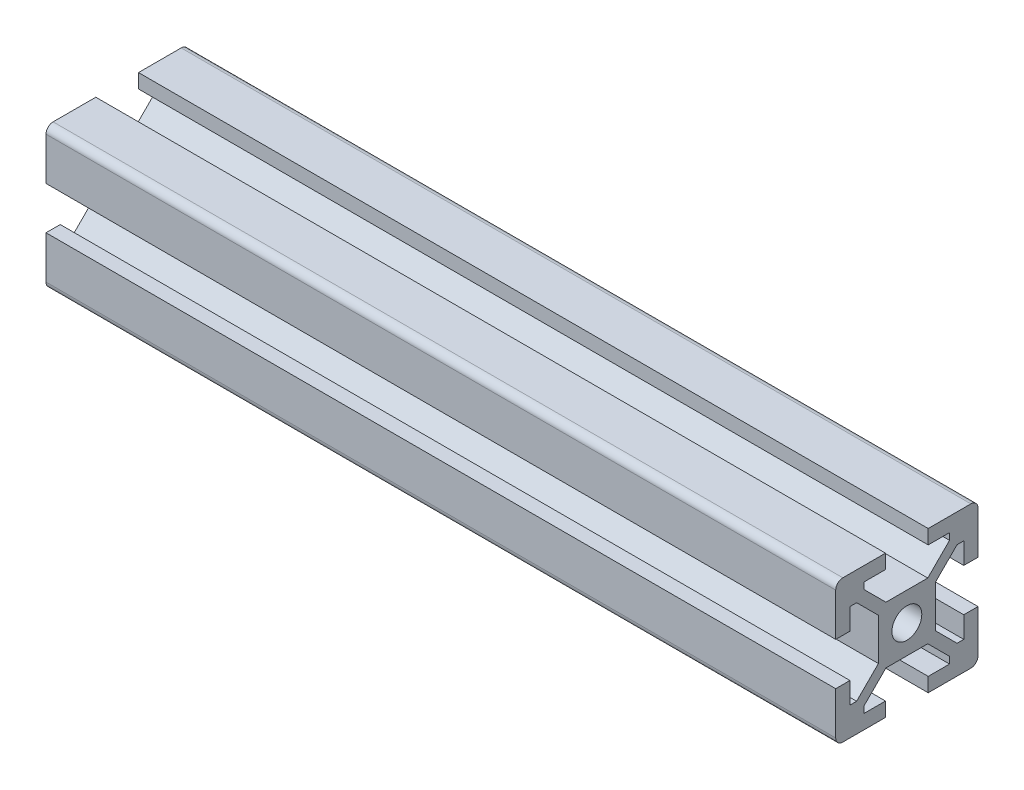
ISO-10303-21;
HEADER;
FILE_DESCRIPTION(('STEP AP214'),'2;1');
FILE_NAME('part.step','',(''),(''),'','','');
FILE_SCHEMA(('AUTOMOTIVE_DESIGN { 1 0 10303 214 1 1 1 1 }'));
ENDSEC;
DATA;
#1=APPLICATION_CONTEXT('core data for automotive mechanical design processes');
#2=APPLICATION_PROTOCOL_DEFINITION('international standard','automotive_design',2000,#1);
#3=PRODUCT_CONTEXT('',#1,'mechanical');
#4=PRODUCT('Part','Part','',(#3));
#5=PRODUCT_RELATED_PRODUCT_CATEGORY('part','',(#4));
#6=PRODUCT_DEFINITION_FORMATION('','',#4);
#7=PRODUCT_DEFINITION_CONTEXT('part definition',#1,'design');
#8=PRODUCT_DEFINITION('design','',#6,#7);
#9=PRODUCT_DEFINITION_SHAPE('','',#8);
#10=(LENGTH_UNIT() NAMED_UNIT(*) SI_UNIT(.MILLI.,.METRE.));
#11=(NAMED_UNIT(*) PLANE_ANGLE_UNIT() SI_UNIT($,.RADIAN.));
#12=(NAMED_UNIT(*) SI_UNIT($,.STERADIAN.) SOLID_ANGLE_UNIT());
#13=UNCERTAINTY_MEASURE_WITH_UNIT(LENGTH_MEASURE(1.E-05),#10,'distance_accuracy_value','');
#14=(GEOMETRIC_REPRESENTATION_CONTEXT(3) GLOBAL_UNCERTAINTY_ASSIGNED_CONTEXT((#13)) GLOBAL_UNIT_ASSIGNED_CONTEXT((#10,
#11,#12)) REPRESENTATION_CONTEXT('',''));
#15=CARTESIAN_POINT('',(0.,0.,0.));
#16=DIRECTION('',(0.,0.,1.));
#17=DIRECTION('',(1.,0.,0.));
#18=AXIS2_PLACEMENT_3D('',#15,#16,#17);
#19=CARTESIAN_POINT('',(111.,9.,9.));
#20=DIRECTION('',(1.,0.,0.));
#21=DIRECTION('',(0.,0.,-1.));
#22=AXIS2_PLACEMENT_3D('',#19,#20,#21);
#23=PLANE('',#22);
#24=CARTESIAN_POINT('',(111.,9.,9.));
#25=DIRECTION('',(1.,0.,0.));
#26=DIRECTION('',(0.,0.,-1.));
#27=AXIS2_PLACEMENT_3D('',#24,#25,#26);
#28=CIRCLE('',#27,1.);
#29=CARTESIAN_POINT('',(111.,10.,9.));
#30=VERTEX_POINT('',#29);
#31=CARTESIAN_POINT('',(111.,9.,10.));
#32=VERTEX_POINT('',#31);
#33=EDGE_CURVE('E472',#30,#32,#28,.T.);
#34=ORIENTED_EDGE('',*,*,#33,.T.);
#35=DIRECTION('',(0.,-1.,0.));
#36=VECTOR('',#35,1.);
#37=CARTESIAN_POINT('',(111.,9.,10.));
#38=LINE('',#37,#36);
#39=CARTESIAN_POINT('',(111.,3.,10.));
#40=VERTEX_POINT('',#39);
#41=EDGE_CURVE('E221',#32,#40,#38,.T.);
#42=ORIENTED_EDGE('',*,*,#41,.T.);
#43=DIRECTION('',(0.,0.,-1.));
#44=VECTOR('',#43,1.);
#45=CARTESIAN_POINT('',(111.,3.,10.));
#46=LINE('',#45,#44);
#47=CARTESIAN_POINT('',(111.,3.,8.));
#48=VERTEX_POINT('',#47);
#49=EDGE_CURVE('E606',#40,#48,#46,.T.);
#50=ORIENTED_EDGE('',*,*,#49,.T.);
#51=DIRECTION('',(0.,1.,0.));
#52=VECTOR('',#51,1.);
#53=CARTESIAN_POINT('',(111.,3.,8.));
#54=LINE('',#53,#52);
#55=CARTESIAN_POINT('',(111.,6.,8.));
#56=VERTEX_POINT('',#55);
#57=EDGE_CURVE('E629',#48,#56,#54,.T.);
#58=ORIENTED_EDGE('',*,*,#57,.T.);
#59=DIRECTION('',(0.,0.,-1.));
#60=VECTOR('',#59,1.);
#61=CARTESIAN_POINT('',(111.,6.,8.));
#62=LINE('',#61,#60);
#63=CARTESIAN_POINT('',(111.,6.,7.06066017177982));
#64=VERTEX_POINT('',#63);
#65=EDGE_CURVE('E623',#56,#64,#62,.T.);
#66=ORIENTED_EDGE('',*,*,#65,.T.);
#67=DIRECTION('',(0.,-0.707106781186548,-0.707106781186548));
#68=VECTOR('',#67,1.);
#69=CARTESIAN_POINT('',(111.,6.,7.06066017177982));
#70=LINE('',#69,#68);
#71=CARTESIAN_POINT('',(111.,2.93933982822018,4.));
#72=VERTEX_POINT('',#71);
#73=EDGE_CURVE('E628',#64,#72,#70,.T.);
#74=ORIENTED_EDGE('',*,*,#73,.T.);
#75=DIRECTION('',(0.,-1.,0.));
#76=VECTOR('',#75,1.);
#77=CARTESIAN_POINT('',(111.,2.93933982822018,4.));
#78=LINE('',#77,#76);
#79=CARTESIAN_POINT('',(111.,-2.93933982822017,4.));
#80=VERTEX_POINT('',#79);
#81=EDGE_CURVE('E630',#72,#80,#78,.T.);
#82=ORIENTED_EDGE('',*,*,#81,.T.);
#83=DIRECTION('',(0.,-0.707106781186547,0.707106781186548));
#84=VECTOR('',#83,1.);
#85=CARTESIAN_POINT('',(111.,-2.93933982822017,4.));
#86=LINE('',#85,#84);
#87=CARTESIAN_POINT('',(111.,-6.,7.06066017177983));
#88=VERTEX_POINT('',#87);
#89=EDGE_CURVE('E634',#80,#88,#86,.T.);
#90=ORIENTED_EDGE('',*,*,#89,.T.);
#91=DIRECTION('',(0.,0.,1.));
#92=VECTOR('',#91,1.);
#93=CARTESIAN_POINT('',(111.,-6.,7.06066017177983));
#94=LINE('',#93,#92);
#95=CARTESIAN_POINT('',(111.,-6.,7.99999999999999));
#96=VERTEX_POINT('',#95);
#97=EDGE_CURVE('E640',#88,#96,#94,.T.);
#98=ORIENTED_EDGE('',*,*,#97,.T.);
#99=DIRECTION('',(0.,1.,0.));
#100=VECTOR('',#99,1.);
#101=CARTESIAN_POINT('',(111.,-6.,7.99999999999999));
#102=LINE('',#101,#100);
#103=CARTESIAN_POINT('',(111.,-3.,7.99999999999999));
#104=VERTEX_POINT('',#103);
#105=EDGE_CURVE('E639',#96,#104,#102,.T.);
#106=ORIENTED_EDGE('',*,*,#105,.T.);
#107=DIRECTION('',(0.,0.,1.));
#108=VECTOR('',#107,1.);
#109=CARTESIAN_POINT('',(111.,-3.,7.99999999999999));
#110=LINE('',#109,#108);
#111=CARTESIAN_POINT('',(111.,-3.,10.));
#112=VERTEX_POINT('',#111);
#113=EDGE_CURVE('E641',#104,#112,#110,.T.);
#114=ORIENTED_EDGE('',*,*,#113,.T.);
#115=DIRECTION('',(0.,-1.,0.));
#116=VECTOR('',#115,1.);
#117=CARTESIAN_POINT('',(111.,-3.,10.));
#118=LINE('',#117,#116);
#119=CARTESIAN_POINT('',(111.,-9.,10.));
#120=VERTEX_POINT('',#119);
#121=EDGE_CURVE('E643',#112,#120,#118,.T.);
#122=ORIENTED_EDGE('',*,*,#121,.T.);
#123=CARTESIAN_POINT('',(111.,-9.,9.));
#124=DIRECTION('',(1.,0.,0.));
#125=DIRECTION('',(0.,0.,-1.));
#126=AXIS2_PLACEMENT_3D('',#123,#124,#125);
#127=CIRCLE('',#126,1.);
#128=CARTESIAN_POINT('',(111.,-10.,9.));
#129=VERTEX_POINT('',#128);
#130=EDGE_CURVE('E644',#120,#129,#127,.T.);
#131=ORIENTED_EDGE('',*,*,#130,.T.);
#132=DIRECTION('',(0.,0.,-1.));
#133=VECTOR('',#132,1.);
#134=CARTESIAN_POINT('',(111.,-10.,9.));
#135=LINE('',#134,#133);
#136=CARTESIAN_POINT('',(111.,-10.,3.));
#137=VERTEX_POINT('',#136);
#138=EDGE_CURVE('E650',#129,#137,#135,.T.);
#139=ORIENTED_EDGE('',*,*,#138,.T.);
#140=DIRECTION('',(0.,1.,0.));
#141=VECTOR('',#140,1.);
#142=CARTESIAN_POINT('',(111.,-10.,3.));
#143=LINE('',#142,#141);
#144=CARTESIAN_POINT('',(111.,-8.,3.));
#145=VERTEX_POINT('',#144);
#146=EDGE_CURVE('E647',#137,#145,#143,.T.);
#147=ORIENTED_EDGE('',*,*,#146,.T.);
#148=DIRECTION('',(0.,0.,1.));
#149=VECTOR('',#148,1.);
#150=CARTESIAN_POINT('',(111.,-8.,3.));
#151=LINE('',#150,#149);
#152=CARTESIAN_POINT('',(111.,-8.,6.));
#153=VERTEX_POINT('',#152);
#154=EDGE_CURVE('E651',#145,#153,#151,.T.);
#155=ORIENTED_EDGE('',*,*,#154,.T.);
#156=DIRECTION('',(0.,1.,0.));
#157=VECTOR('',#156,1.);
#158=CARTESIAN_POINT('',(111.,-8.,6.));
#159=LINE('',#158,#157);
#160=CARTESIAN_POINT('',(111.,-7.06066017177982,6.));
#161=VERTEX_POINT('',#160);
#162=EDGE_CURVE('E652',#153,#161,#159,.T.);
#163=ORIENTED_EDGE('',*,*,#162,.T.);
#164=DIRECTION('',(0.,0.707106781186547,-0.707106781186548));
#165=VECTOR('',#164,1.);
#166=CARTESIAN_POINT('',(111.,-7.06066017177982,6.));
#167=LINE('',#166,#165);
#168=CARTESIAN_POINT('',(111.,-4.,2.93933982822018));
#169=VERTEX_POINT('',#168);
#170=EDGE_CURVE('E654',#161,#169,#167,.T.);
#171=ORIENTED_EDGE('',*,*,#170,.T.);
#172=DIRECTION('',(0.,0.,-1.));
#173=VECTOR('',#172,1.);
#174=CARTESIAN_POINT('',(111.,-4.,2.93933982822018));
#175=LINE('',#174,#173);
#176=CARTESIAN_POINT('',(111.,-4.,-2.93933982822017));
#177=VERTEX_POINT('',#176);
#178=EDGE_CURVE('E660',#169,#177,#175,.T.);
#179=ORIENTED_EDGE('',*,*,#178,.T.);
#180=DIRECTION('',(0.,-0.707106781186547,-0.707106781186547));
#181=VECTOR('',#180,1.);
#182=CARTESIAN_POINT('',(111.,-4.,-2.93933982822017));
#183=LINE('',#182,#181);
#184=CARTESIAN_POINT('',(111.,-7.06066017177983,-6.));
#185=VERTEX_POINT('',#184);
#186=EDGE_CURVE('E656',#177,#185,#183,.T.);
#187=ORIENTED_EDGE('',*,*,#186,.T.);
#188=DIRECTION('',(0.,-1.,0.));
#189=VECTOR('',#188,1.);
#190=CARTESIAN_POINT('',(111.,-7.06066017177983,-6.));
#191=LINE('',#190,#189);
#192=CARTESIAN_POINT('',(111.,-7.99999999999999,-6.));
#193=VERTEX_POINT('',#192);
#194=EDGE_CURVE('E662',#185,#193,#191,.T.);
#195=ORIENTED_EDGE('',*,*,#194,.T.);
#196=DIRECTION('',(0.,0.,1.));
#197=VECTOR('',#196,1.);
#198=CARTESIAN_POINT('',(111.,-7.99999999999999,-6.));
#199=LINE('',#198,#197);
#200=CARTESIAN_POINT('',(111.,-7.99999999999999,-3.));
#201=VERTEX_POINT('',#200);
#202=EDGE_CURVE('E663',#193,#201,#199,.T.);
#203=ORIENTED_EDGE('',*,*,#202,.T.);
#204=DIRECTION('',(0.,-1.,0.));
#205=VECTOR('',#204,1.);
#206=CARTESIAN_POINT('',(111.,-7.99999999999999,-3.));
#207=LINE('',#206,#205);
#208=CARTESIAN_POINT('',(111.,-10.,-3.));
#209=VERTEX_POINT('',#208);
#210=EDGE_CURVE('E661',#201,#209,#207,.T.);
#211=ORIENTED_EDGE('',*,*,#210,.T.);
#212=DIRECTION('',(0.,0.,-1.));
#213=VECTOR('',#212,1.);
#214=CARTESIAN_POINT('',(111.,-10.,-3.));
#215=LINE('',#214,#213);
#216=CARTESIAN_POINT('',(111.,-10.,-9.00000000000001));
#217=VERTEX_POINT('',#216);
#218=EDGE_CURVE('E670',#209,#217,#215,.T.);
#219=ORIENTED_EDGE('',*,*,#218,.T.);
#220=CARTESIAN_POINT('',(111.,-9.,-9.00000000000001));
#221=DIRECTION('',(1.,0.,0.));
#222=DIRECTION('',(0.,0.,-1.));
#223=AXIS2_PLACEMENT_3D('',#220,#221,#222);
#224=CIRCLE('',#223,0.999999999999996);
#225=CARTESIAN_POINT('',(111.,-9.,-10.));
#226=VERTEX_POINT('',#225);
#227=EDGE_CURVE('E667',#217,#226,#224,.T.);
#228=ORIENTED_EDGE('',*,*,#227,.T.);
#229=DIRECTION('',(0.,1.,0.));
#230=VECTOR('',#229,1.);
#231=CARTESIAN_POINT('',(111.,-9.,-10.));
#232=LINE('',#231,#230);
#233=CARTESIAN_POINT('',(111.,-3.,-10.));
#234=VERTEX_POINT('',#233);
#235=EDGE_CURVE('E671',#226,#234,#232,.T.);
#236=ORIENTED_EDGE('',*,*,#235,.T.);
#237=DIRECTION('',(0.,0.,1.));
#238=VECTOR('',#237,1.);
#239=CARTESIAN_POINT('',(111.,-3.,-10.));
#240=LINE('',#239,#238);
#241=CARTESIAN_POINT('',(111.,-3.,-8.00000000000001));
#242=VERTEX_POINT('',#241);
#243=EDGE_CURVE('E672',#234,#242,#240,.T.);
#244=ORIENTED_EDGE('',*,*,#243,.T.);
#245=DIRECTION('',(0.,-1.,0.));
#246=VECTOR('',#245,1.);
#247=CARTESIAN_POINT('',(111.,-3.,-8.00000000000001));
#248=LINE('',#247,#246);
#249=CARTESIAN_POINT('',(111.,-6.,-8.00000000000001));
#250=VERTEX_POINT('',#249);
#251=EDGE_CURVE('E674',#242,#250,#248,.T.);
#252=ORIENTED_EDGE('',*,*,#251,.T.);
#253=DIRECTION('',(0.,0.,1.));
#254=VECTOR('',#253,1.);
#255=CARTESIAN_POINT('',(111.,-6.,-8.00000000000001));
#256=LINE('',#255,#254);
#257=CARTESIAN_POINT('',(111.,-6.,-7.06066017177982));
#258=VERTEX_POINT('',#257);
#259=EDGE_CURVE('E679',#250,#258,#256,.T.);
#260=ORIENTED_EDGE('',*,*,#259,.T.);
#261=DIRECTION('',(0.,0.707106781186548,0.707106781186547));
#262=VECTOR('',#261,1.);
#263=CARTESIAN_POINT('',(111.,-6.,-7.06066017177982));
#264=LINE('',#263,#262);
#265=CARTESIAN_POINT('',(111.,-2.93933982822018,-4.));
#266=VERTEX_POINT('',#265);
#267=EDGE_CURVE('E680',#258,#266,#264,.T.);
#268=ORIENTED_EDGE('',*,*,#267,.T.);
#269=DIRECTION('',(0.,1.,0.));
#270=VECTOR('',#269,1.);
#271=CARTESIAN_POINT('',(111.,-2.93933982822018,-4.));
#272=LINE('',#271,#270);
#273=CARTESIAN_POINT('',(111.,2.93933982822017,-4.));
#274=VERTEX_POINT('',#273);
#275=EDGE_CURVE('E682',#266,#274,#272,.T.);
#276=ORIENTED_EDGE('',*,*,#275,.T.);
#277=DIRECTION('',(0.,0.707106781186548,-0.707106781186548));
#278=VECTOR('',#277,1.);
#279=CARTESIAN_POINT('',(111.,2.93933982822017,-4.));
#280=LINE('',#279,#278);
#281=CARTESIAN_POINT('',(111.,6.,-7.06066017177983));
#282=VERTEX_POINT('',#281);
#283=EDGE_CURVE('E681',#274,#282,#280,.T.);
#284=ORIENTED_EDGE('',*,*,#283,.T.);
#285=DIRECTION('',(0.,0.,-1.));
#286=VECTOR('',#285,1.);
#287=CARTESIAN_POINT('',(111.,6.,-7.06066017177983));
#288=LINE('',#287,#286);
#289=CARTESIAN_POINT('',(111.,6.,-7.99999999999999));
#290=VERTEX_POINT('',#289);
#291=EDGE_CURVE('E683',#282,#290,#288,.T.);
#292=ORIENTED_EDGE('',*,*,#291,.T.);
#293=DIRECTION('',(0.,-1.,0.));
#294=VECTOR('',#293,1.);
#295=CARTESIAN_POINT('',(111.,6.,-7.99999999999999));
#296=LINE('',#295,#294);
#297=CARTESIAN_POINT('',(111.,3.,-7.99999999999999));
#298=VERTEX_POINT('',#297);
#299=EDGE_CURVE('E690',#290,#298,#296,.T.);
#300=ORIENTED_EDGE('',*,*,#299,.T.);
#301=DIRECTION('',(0.,0.,-1.));
#302=VECTOR('',#301,1.);
#303=CARTESIAN_POINT('',(111.,3.,-7.99999999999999));
#304=LINE('',#303,#302);
#305=CARTESIAN_POINT('',(111.,3.,-10.));
#306=VERTEX_POINT('',#305);
#307=EDGE_CURVE('E689',#298,#306,#304,.T.);
#308=ORIENTED_EDGE('',*,*,#307,.T.);
#309=DIRECTION('',(0.,1.,0.));
#310=VECTOR('',#309,1.);
#311=CARTESIAN_POINT('',(111.,3.,-10.));
#312=LINE('',#311,#310);
#313=CARTESIAN_POINT('',(111.,9.,-10.));
#314=VERTEX_POINT('',#313);
#315=EDGE_CURVE('E693',#306,#314,#312,.T.);
#316=ORIENTED_EDGE('',*,*,#315,.T.);
#317=CARTESIAN_POINT('',(111.,9.,-9.00000000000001));
#318=DIRECTION('',(1.,0.,0.));
#319=DIRECTION('',(0.,0.,-1.));
#320=AXIS2_PLACEMENT_3D('',#317,#318,#319);
#321=CIRCLE('',#320,1.);
#322=CARTESIAN_POINT('',(111.,10.,-9.00000000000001));
#323=VERTEX_POINT('',#322);
#324=EDGE_CURVE('E691',#314,#323,#321,.T.);
#325=ORIENTED_EDGE('',*,*,#324,.T.);
#326=DIRECTION('',(0.,0.,1.));
#327=VECTOR('',#326,1.);
#328=CARTESIAN_POINT('',(111.,10.,-9.00000000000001));
#329=LINE('',#328,#327);
#330=CARTESIAN_POINT('',(111.,10.,-3.));
#331=VERTEX_POINT('',#330);
#332=EDGE_CURVE('E694',#323,#331,#329,.T.);
#333=ORIENTED_EDGE('',*,*,#332,.T.);
#334=DIRECTION('',(0.,-1.,0.));
#335=VECTOR('',#334,1.);
#336=CARTESIAN_POINT('',(111.,10.,-3.));
#337=LINE('',#336,#335);
#338=CARTESIAN_POINT('',(111.,8.,-3.));
#339=VERTEX_POINT('',#338);
#340=EDGE_CURVE('E700',#331,#339,#337,.T.);
#341=ORIENTED_EDGE('',*,*,#340,.T.);
#342=DIRECTION('',(0.,0.,-1.));
#343=VECTOR('',#342,1.);
#344=CARTESIAN_POINT('',(111.,8.,-3.));
#345=LINE('',#344,#343);
#346=CARTESIAN_POINT('',(111.,8.,-6.));
#347=VERTEX_POINT('',#346);
#348=EDGE_CURVE('E698',#339,#347,#345,.T.);
#349=ORIENTED_EDGE('',*,*,#348,.T.);
#350=DIRECTION('',(0.,-1.,0.));
#351=VECTOR('',#350,1.);
#352=CARTESIAN_POINT('',(111.,8.,-6.));
#353=LINE('',#352,#351);
#354=CARTESIAN_POINT('',(111.,7.06066017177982,-6.));
#355=VERTEX_POINT('',#354);
#356=EDGE_CURVE('E703',#347,#355,#353,.T.);
#357=ORIENTED_EDGE('',*,*,#356,.T.);
#358=DIRECTION('',(0.,-0.707106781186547,0.707106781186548));
#359=VECTOR('',#358,1.);
#360=CARTESIAN_POINT('',(111.,7.06066017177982,-6.));
#361=LINE('',#360,#359);
#362=CARTESIAN_POINT('',(111.,4.,-2.93933982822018));
#363=VERTEX_POINT('',#362);
#364=EDGE_CURVE('E702',#355,#363,#361,.T.);
#365=ORIENTED_EDGE('',*,*,#364,.T.);
#366=DIRECTION('',(0.,0.,1.));
#367=VECTOR('',#366,1.);
#368=CARTESIAN_POINT('',(111.,4.,-2.93933982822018));
#369=LINE('',#368,#367);
#370=CARTESIAN_POINT('',(111.,4.,2.93933982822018));
#371=VERTEX_POINT('',#370);
#372=EDGE_CURVE('E701',#363,#371,#369,.T.);
#373=ORIENTED_EDGE('',*,*,#372,.T.);
#374=DIRECTION('',(0.,0.707106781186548,0.707106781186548));
#375=VECTOR('',#374,1.);
#376=CARTESIAN_POINT('',(111.,4.,2.93933982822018));
#377=LINE('',#376,#375);
#378=CARTESIAN_POINT('',(111.,7.06066017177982,6.));
#379=VERTEX_POINT('',#378);
#380=EDGE_CURVE('E707',#371,#379,#377,.T.);
#381=ORIENTED_EDGE('',*,*,#380,.T.);
#382=DIRECTION('',(0.,1.,0.));
#383=VECTOR('',#382,1.);
#384=CARTESIAN_POINT('',(111.,7.06066017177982,6.));
#385=LINE('',#384,#383);
#386=CARTESIAN_POINT('',(111.,7.99999999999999,6.));
#387=VERTEX_POINT('',#386);
#388=EDGE_CURVE('E358',#379,#387,#385,.T.);
#389=ORIENTED_EDGE('',*,*,#388,.T.);
#390=DIRECTION('',(0.,0.,-1.));
#391=VECTOR('',#390,1.);
#392=CARTESIAN_POINT('',(111.,7.99999999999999,6.));
#393=LINE('',#392,#391);
#394=CARTESIAN_POINT('',(111.,7.99999999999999,3.));
#395=VERTEX_POINT('',#394);
#396=EDGE_CURVE('E353',#387,#395,#393,.T.);
#397=ORIENTED_EDGE('',*,*,#396,.T.);
#398=DIRECTION('',(0.,1.,0.));
#399=VECTOR('',#398,1.);
#400=CARTESIAN_POINT('',(111.,7.99999999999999,3.));
#401=LINE('',#400,#399);
#402=CARTESIAN_POINT('',(111.,10.,3.));
#403=VERTEX_POINT('',#402);
#404=EDGE_CURVE('E359',#395,#403,#401,.T.);
#405=ORIENTED_EDGE('',*,*,#404,.T.);
#406=DIRECTION('',(0.,0.,1.));
#407=VECTOR('',#406,1.);
#408=CARTESIAN_POINT('',(111.,10.,3.));
#409=LINE('',#408,#407);
#410=EDGE_CURVE('E59',#403,#30,#409,.T.);
#411=ORIENTED_EDGE('',*,*,#410,.T.);
#412=EDGE_LOOP('',(#34,#42,#50,#58,#66,#74,#82,#90,#98,#106,#114,#122,#131,#139,#147,#155,#163,
#171,#179,#187,#195,#203,#211,#219,#228,#236,#244,#252,#260,#268,#276,#284,#292,#300,#308,#316,
#325,#333,#341,#349,#357,#365,#373,#381,#389,#397,#405,#411));
#413=FACE_BOUND('',#412,.T.);
#414=CARTESIAN_POINT('',(111.,0.,0.));
#415=DIRECTION('',(1.,0.,0.));
#416=DIRECTION('',(0.,0.,-1.));
#417=AXIS2_PLACEMENT_3D('',#414,#415,#416);
#418=CIRCLE('',#417,2.1);
#419=CARTESIAN_POINT('',(111.,0.,-2.1));
#420=VERTEX_POINT('',#419);
#421=EDGE_CURVE('E385',#420,#420,#418,.T.);
#422=ORIENTED_EDGE('',*,*,#421,.F.);
#423=EDGE_LOOP('',(#422));
#424=FACE_BOUND('',#423,.T.);
#425=ADVANCED_FACE('F41',(#413,#424),#23,.T.);
#426=CARTESIAN_POINT('',(0.,9.,9.));
#427=DIRECTION('',(1.,0.,0.));
#428=DIRECTION('',(0.,0.,-1.));
#429=AXIS2_PLACEMENT_3D('',#426,#427,#428);
#430=PLANE('',#429);
#431=CARTESIAN_POINT('',(0.,9.,9.));
#432=DIRECTION('',(1.,0.,0.));
#433=DIRECTION('',(0.,0.,-1.));
#434=AXIS2_PLACEMENT_3D('',#431,#432,#433);
#435=CIRCLE('',#434,1.);
#436=CARTESIAN_POINT('',(0.,10.,9.));
#437=VERTEX_POINT('',#436);
#438=CARTESIAN_POINT('',(0.,9.,10.));
#439=VERTEX_POINT('',#438);
#440=EDGE_CURVE('E377',#437,#439,#435,.T.);
#441=ORIENTED_EDGE('',*,*,#440,.F.);
#442=DIRECTION('',(0.,0.,1.));
#443=VECTOR('',#442,1.);
#444=CARTESIAN_POINT('',(0.,10.,3.));
#445=LINE('',#444,#443);
#446=CARTESIAN_POINT('',(0.,10.,3.));
#447=VERTEX_POINT('',#446);
#448=EDGE_CURVE('E213',#447,#437,#445,.T.);
#449=ORIENTED_EDGE('',*,*,#448,.F.);
#450=DIRECTION('',(0.,1.,0.));
#451=VECTOR('',#450,1.);
#452=CARTESIAN_POINT('',(0.,7.99999999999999,3.));
#453=LINE('',#452,#451);
#454=CARTESIAN_POINT('',(0.,7.99999999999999,3.));
#455=VERTEX_POINT('',#454);
#456=EDGE_CURVE('E210',#455,#447,#453,.T.);
#457=ORIENTED_EDGE('',*,*,#456,.F.);
#458=DIRECTION('',(0.,0.,-1.));
#459=VECTOR('',#458,1.);
#460=CARTESIAN_POINT('',(0.,7.99999999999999,6.));
#461=LINE('',#460,#459);
#462=CARTESIAN_POINT('',(0.,7.99999999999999,6.));
#463=VERTEX_POINT('',#462);
#464=EDGE_CURVE('E366',#463,#455,#461,.T.);
#465=ORIENTED_EDGE('',*,*,#464,.F.);
#466=DIRECTION('',(0.,1.,0.));
#467=VECTOR('',#466,1.);
#468=CARTESIAN_POINT('',(0.,7.06066017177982,6.));
#469=LINE('',#468,#467);
#470=CARTESIAN_POINT('',(0.,7.06066017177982,6.));
#471=VERTEX_POINT('',#470);
#472=EDGE_CURVE('E466',#471,#463,#469,.T.);
#473=ORIENTED_EDGE('',*,*,#472,.F.);
#474=DIRECTION('',(0.,0.707106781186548,0.707106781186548));
#475=VECTOR('',#474,1.);
#476=CARTESIAN_POINT('',(0.,4.,2.93933982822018));
#477=LINE('',#476,#475);
#478=CARTESIAN_POINT('',(0.,4.,2.93933982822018));
#479=VERTEX_POINT('',#478);
#480=EDGE_CURVE('E468',#479,#471,#477,.T.);
#481=ORIENTED_EDGE('',*,*,#480,.F.);
#482=DIRECTION('',(0.,0.,1.));
#483=VECTOR('',#482,1.);
#484=CARTESIAN_POINT('',(0.,4.,-2.93933982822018));
#485=LINE('',#484,#483);
#486=CARTESIAN_POINT('',(0.,4.,-2.93933982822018));
#487=VERTEX_POINT('',#486);
#488=EDGE_CURVE('E464',#487,#479,#485,.T.);
#489=ORIENTED_EDGE('',*,*,#488,.F.);
#490=DIRECTION('',(0.,-0.707106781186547,0.707106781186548));
#491=VECTOR('',#490,1.);
#492=CARTESIAN_POINT('',(0.,7.06066017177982,-6.));
#493=LINE('',#492,#491);
#494=CARTESIAN_POINT('',(0.,7.06066017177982,-6.));
#495=VERTEX_POINT('',#494);
#496=EDGE_CURVE('E465',#495,#487,#493,.T.);
#497=ORIENTED_EDGE('',*,*,#496,.F.);
#498=DIRECTION('',(0.,-1.,0.));
#499=VECTOR('',#498,1.);
#500=CARTESIAN_POINT('',(0.,8.,-6.));
#501=LINE('',#500,#499);
#502=CARTESIAN_POINT('',(0.,8.,-6.));
#503=VERTEX_POINT('',#502);
#504=EDGE_CURVE('E458',#503,#495,#501,.T.);
#505=ORIENTED_EDGE('',*,*,#504,.F.);
#506=DIRECTION('',(0.,0.,-1.));
#507=VECTOR('',#506,1.);
#508=CARTESIAN_POINT('',(0.,8.,-3.));
#509=LINE('',#508,#507);
#510=CARTESIAN_POINT('',(0.,8.,-3.));
#511=VERTEX_POINT('',#510);
#512=EDGE_CURVE('E456',#511,#503,#509,.T.);
#513=ORIENTED_EDGE('',*,*,#512,.F.);
#514=DIRECTION('',(0.,-1.,0.));
#515=VECTOR('',#514,1.);
#516=CARTESIAN_POINT('',(0.,10.,-3.));
#517=LINE('',#516,#515);
#518=CARTESIAN_POINT('',(0.,10.,-3.));
#519=VERTEX_POINT('',#518);
#520=EDGE_CURVE('E457',#519,#511,#517,.T.);
#521=ORIENTED_EDGE('',*,*,#520,.F.);
#522=DIRECTION('',(0.,0.,1.));
#523=VECTOR('',#522,1.);
#524=CARTESIAN_POINT('',(0.,10.,-9.00000000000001));
#525=LINE('',#524,#523);
#526=CARTESIAN_POINT('',(0.,10.,-9.00000000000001));
#527=VERTEX_POINT('',#526);
#528=EDGE_CURVE('E455',#527,#519,#525,.T.);
#529=ORIENTED_EDGE('',*,*,#528,.F.);
#530=CARTESIAN_POINT('',(0.,9.,-9.00000000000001));
#531=DIRECTION('',(1.,0.,0.));
#532=DIRECTION('',(0.,0.,-1.));
#533=AXIS2_PLACEMENT_3D('',#530,#531,#532);
#534=CIRCLE('',#533,1.);
#535=CARTESIAN_POINT('',(0.,9.,-10.));
#536=VERTEX_POINT('',#535);
#537=EDGE_CURVE('E454',#536,#527,#534,.T.);
#538=ORIENTED_EDGE('',*,*,#537,.F.);
#539=DIRECTION('',(0.,1.,0.));
#540=VECTOR('',#539,1.);
#541=CARTESIAN_POINT('',(0.,3.,-10.));
#542=LINE('',#541,#540);
#543=CARTESIAN_POINT('',(0.,3.,-10.));
#544=VERTEX_POINT('',#543);
#545=EDGE_CURVE('E449',#544,#536,#542,.T.);
#546=ORIENTED_EDGE('',*,*,#545,.F.);
#547=DIRECTION('',(0.,0.,-1.));
#548=VECTOR('',#547,1.);
#549=CARTESIAN_POINT('',(0.,3.,-7.99999999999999));
#550=LINE('',#549,#548);
#551=CARTESIAN_POINT('',(0.,3.,-7.99999999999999));
#552=VERTEX_POINT('',#551);
#553=EDGE_CURVE('E447',#552,#544,#550,.T.);
#554=ORIENTED_EDGE('',*,*,#553,.F.);
#555=DIRECTION('',(0.,-1.,0.));
#556=VECTOR('',#555,1.);
#557=CARTESIAN_POINT('',(0.,6.,-7.99999999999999));
#558=LINE('',#557,#556);
#559=CARTESIAN_POINT('',(0.,6.,-7.99999999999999));
#560=VERTEX_POINT('',#559);
#561=EDGE_CURVE('E446',#560,#552,#558,.T.);
#562=ORIENTED_EDGE('',*,*,#561,.F.);
#563=DIRECTION('',(0.,0.,-1.));
#564=VECTOR('',#563,1.);
#565=CARTESIAN_POINT('',(0.,6.,-7.06066017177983));
#566=LINE('',#565,#564);
#567=CARTESIAN_POINT('',(0.,6.,-7.06066017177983));
#568=VERTEX_POINT('',#567);
#569=EDGE_CURVE('E442',#568,#560,#566,.T.);
#570=ORIENTED_EDGE('',*,*,#569,.F.);
#571=DIRECTION('',(0.,0.707106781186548,-0.707106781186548));
#572=VECTOR('',#571,1.);
#573=CARTESIAN_POINT('',(0.,2.93933982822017,-4.));
#574=LINE('',#573,#572);
#575=CARTESIAN_POINT('',(0.,2.93933982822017,-4.));
#576=VERTEX_POINT('',#575);
#577=EDGE_CURVE('E445',#576,#568,#574,.T.);
#578=ORIENTED_EDGE('',*,*,#577,.F.);
#579=DIRECTION('',(0.,1.,0.));
#580=VECTOR('',#579,1.);
#581=CARTESIAN_POINT('',(0.,-2.93933982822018,-4.));
#582=LINE('',#581,#580);
#583=CARTESIAN_POINT('',(0.,-2.93933982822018,-4.));
#584=VERTEX_POINT('',#583);
#585=EDGE_CURVE('E436',#584,#576,#582,.T.);
#586=ORIENTED_EDGE('',*,*,#585,.F.);
#587=DIRECTION('',(0.,0.707106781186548,0.707106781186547));
#588=VECTOR('',#587,1.);
#589=CARTESIAN_POINT('',(0.,-6.,-7.06066017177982));
#590=LINE('',#589,#588);
#591=CARTESIAN_POINT('',(0.,-6.,-7.06066017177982));
#592=VERTEX_POINT('',#591);
#593=EDGE_CURVE('E438',#592,#584,#590,.T.);
#594=ORIENTED_EDGE('',*,*,#593,.F.);
#595=DIRECTION('',(0.,0.,1.));
#596=VECTOR('',#595,1.);
#597=CARTESIAN_POINT('',(0.,-6.,-8.00000000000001));
#598=LINE('',#597,#596);
#599=CARTESIAN_POINT('',(0.,-6.,-8.00000000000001));
#600=VERTEX_POINT('',#599);
#601=EDGE_CURVE('E437',#600,#592,#598,.T.);
#602=ORIENTED_EDGE('',*,*,#601,.F.);
#603=DIRECTION('',(0.,-1.,0.));
#604=VECTOR('',#603,1.);
#605=CARTESIAN_POINT('',(0.,-3.,-8.00000000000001));
#606=LINE('',#605,#604);
#607=CARTESIAN_POINT('',(0.,-3.,-8.00000000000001));
#608=VERTEX_POINT('',#607);
#609=EDGE_CURVE('E431',#608,#600,#606,.T.);
#610=ORIENTED_EDGE('',*,*,#609,.F.);
#611=DIRECTION('',(0.,0.,1.));
#612=VECTOR('',#611,1.);
#613=CARTESIAN_POINT('',(0.,-3.,-10.));
#614=LINE('',#613,#612);
#615=CARTESIAN_POINT('',(0.,-3.,-10.));
#616=VERTEX_POINT('',#615);
#617=EDGE_CURVE('E435',#616,#608,#614,.T.);
#618=ORIENTED_EDGE('',*,*,#617,.F.);
#619=DIRECTION('',(0.,1.,0.));
#620=VECTOR('',#619,1.);
#621=CARTESIAN_POINT('',(0.,-9.,-10.));
#622=LINE('',#621,#620);
#623=CARTESIAN_POINT('',(0.,-9.,-10.));
#624=VERTEX_POINT('',#623);
#625=EDGE_CURVE('E429',#624,#616,#622,.T.);
#626=ORIENTED_EDGE('',*,*,#625,.F.);
#627=CARTESIAN_POINT('',(0.,-9.,-9.00000000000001));
#628=DIRECTION('',(1.,0.,0.));
#629=DIRECTION('',(0.,0.,-1.));
#630=AXIS2_PLACEMENT_3D('',#627,#628,#629);
#631=CIRCLE('',#630,0.999999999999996);
#632=CARTESIAN_POINT('',(0.,-10.,-9.00000000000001));
#633=VERTEX_POINT('',#632);
#634=EDGE_CURVE('E427',#633,#624,#631,.T.);
#635=ORIENTED_EDGE('',*,*,#634,.F.);
#636=DIRECTION('',(0.,0.,-1.));
#637=VECTOR('',#636,1.);
#638=CARTESIAN_POINT('',(0.,-10.,-3.));
#639=LINE('',#638,#637);
#640=CARTESIAN_POINT('',(0.,-10.,-3.));
#641=VERTEX_POINT('',#640);
#642=EDGE_CURVE('E426',#641,#633,#639,.T.);
#643=ORIENTED_EDGE('',*,*,#642,.F.);
#644=DIRECTION('',(0.,-1.,0.));
#645=VECTOR('',#644,1.);
#646=CARTESIAN_POINT('',(0.,-7.99999999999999,-3.));
#647=LINE('',#646,#645);
#648=CARTESIAN_POINT('',(0.,-7.99999999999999,-3.));
#649=VERTEX_POINT('',#648);
#650=EDGE_CURVE('E422',#649,#641,#647,.T.);
#651=ORIENTED_EDGE('',*,*,#650,.F.);
#652=DIRECTION('',(0.,0.,1.));
#653=VECTOR('',#652,1.);
#654=CARTESIAN_POINT('',(0.,-7.99999999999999,-6.));
#655=LINE('',#654,#653);
#656=CARTESIAN_POINT('',(0.,-7.99999999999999,-6.));
#657=VERTEX_POINT('',#656);
#658=EDGE_CURVE('E425',#657,#649,#655,.T.);
#659=ORIENTED_EDGE('',*,*,#658,.F.);
#660=DIRECTION('',(0.,-1.,0.));
#661=VECTOR('',#660,1.);
#662=CARTESIAN_POINT('',(0.,-7.06066017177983,-6.));
#663=LINE('',#662,#661);
#664=CARTESIAN_POINT('',(0.,-7.06066017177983,-6.));
#665=VERTEX_POINT('',#664);
#666=EDGE_CURVE('E419',#665,#657,#663,.T.);
#667=ORIENTED_EDGE('',*,*,#666,.F.);
#668=DIRECTION('',(0.,-0.707106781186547,-0.707106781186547));
#669=VECTOR('',#668,1.);
#670=CARTESIAN_POINT('',(0.,-4.,-2.93933982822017));
#671=LINE('',#670,#669);
#672=CARTESIAN_POINT('',(0.,-4.,-2.93933982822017));
#673=VERTEX_POINT('',#672);
#674=EDGE_CURVE('E418',#673,#665,#671,.T.);
#675=ORIENTED_EDGE('',*,*,#674,.F.);
#676=DIRECTION('',(0.,0.,-1.));
#677=VECTOR('',#676,1.);
#678=CARTESIAN_POINT('',(0.,-4.,2.93933982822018));
#679=LINE('',#678,#677);
#680=CARTESIAN_POINT('',(0.,-4.,2.93933982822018));
#681=VERTEX_POINT('',#680);
#682=EDGE_CURVE('E416',#681,#673,#679,.T.);
#683=ORIENTED_EDGE('',*,*,#682,.F.);
#684=DIRECTION('',(0.,0.707106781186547,-0.707106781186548));
#685=VECTOR('',#684,1.);
#686=CARTESIAN_POINT('',(0.,-7.06066017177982,6.));
#687=LINE('',#686,#685);
#688=CARTESIAN_POINT('',(0.,-7.06066017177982,6.));
#689=VERTEX_POINT('',#688);
#690=EDGE_CURVE('E414',#689,#681,#687,.T.);
#691=ORIENTED_EDGE('',*,*,#690,.F.);
#692=DIRECTION('',(0.,1.,0.));
#693=VECTOR('',#692,1.);
#694=CARTESIAN_POINT('',(0.,-8.,6.));
#695=LINE('',#694,#693);
#696=CARTESIAN_POINT('',(0.,-8.,6.));
#697=VERTEX_POINT('',#696);
#698=EDGE_CURVE('E415',#697,#689,#695,.T.);
#699=ORIENTED_EDGE('',*,*,#698,.F.);
#700=DIRECTION('',(0.,0.,1.));
#701=VECTOR('',#700,1.);
#702=CARTESIAN_POINT('',(0.,-8.,3.));
#703=LINE('',#702,#701);
#704=CARTESIAN_POINT('',(0.,-8.,3.));
#705=VERTEX_POINT('',#704);
#706=EDGE_CURVE('E409',#705,#697,#703,.T.);
#707=ORIENTED_EDGE('',*,*,#706,.F.);
#708=DIRECTION('',(0.,1.,0.));
#709=VECTOR('',#708,1.);
#710=CARTESIAN_POINT('',(0.,-10.,3.));
#711=LINE('',#710,#709);
#712=CARTESIAN_POINT('',(0.,-10.,3.));
#713=VERTEX_POINT('',#712);
#714=EDGE_CURVE('E406',#713,#705,#711,.T.);
#715=ORIENTED_EDGE('',*,*,#714,.F.);
#716=DIRECTION('',(0.,0.,-1.));
#717=VECTOR('',#716,1.);
#718=CARTESIAN_POINT('',(0.,-10.,9.));
#719=LINE('',#718,#717);
#720=CARTESIAN_POINT('',(0.,-10.,9.));
#721=VERTEX_POINT('',#720);
#722=EDGE_CURVE('E408',#721,#713,#719,.T.);
#723=ORIENTED_EDGE('',*,*,#722,.F.);
#724=CARTESIAN_POINT('',(0.,-9.,9.));
#725=DIRECTION('',(1.,0.,0.));
#726=DIRECTION('',(0.,0.,-1.));
#727=AXIS2_PLACEMENT_3D('',#724,#725,#726);
#728=CIRCLE('',#727,1.);
#729=CARTESIAN_POINT('',(0.,-9.,10.));
#730=VERTEX_POINT('',#729);
#731=EDGE_CURVE('E405',#730,#721,#728,.T.);
#732=ORIENTED_EDGE('',*,*,#731,.F.);
#733=DIRECTION('',(0.,-1.,0.));
#734=VECTOR('',#733,1.);
#735=CARTESIAN_POINT('',(0.,-3.,10.));
#736=LINE('',#735,#734);
#737=CARTESIAN_POINT('',(0.,-3.,10.));
#738=VERTEX_POINT('',#737);
#739=EDGE_CURVE('E404',#738,#730,#736,.T.);
#740=ORIENTED_EDGE('',*,*,#739,.F.);
#741=DIRECTION('',(0.,0.,1.));
#742=VECTOR('',#741,1.);
#743=CARTESIAN_POINT('',(0.,-3.,7.99999999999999));
#744=LINE('',#743,#742);
#745=CARTESIAN_POINT('',(0.,-3.,7.99999999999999));
#746=VERTEX_POINT('',#745);
#747=EDGE_CURVE('E399',#746,#738,#744,.T.);
#748=ORIENTED_EDGE('',*,*,#747,.F.);
#749=DIRECTION('',(0.,1.,0.));
#750=VECTOR('',#749,1.);
#751=CARTESIAN_POINT('',(0.,-6.,7.99999999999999));
#752=LINE('',#751,#750);
#753=CARTESIAN_POINT('',(0.,-6.,7.99999999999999));
#754=VERTEX_POINT('',#753);
#755=EDGE_CURVE('E397',#754,#746,#752,.T.);
#756=ORIENTED_EDGE('',*,*,#755,.F.);
#757=DIRECTION('',(0.,0.,1.));
#758=VECTOR('',#757,1.);
#759=CARTESIAN_POINT('',(0.,-6.,7.06066017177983));
#760=LINE('',#759,#758);
#761=CARTESIAN_POINT('',(0.,-6.,7.06066017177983));
#762=VERTEX_POINT('',#761);
#763=EDGE_CURVE('E396',#762,#754,#760,.T.);
#764=ORIENTED_EDGE('',*,*,#763,.F.);
#765=DIRECTION('',(0.,-0.707106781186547,0.707106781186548));
#766=VECTOR('',#765,1.);
#767=CARTESIAN_POINT('',(0.,-2.93933982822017,4.));
#768=LINE('',#767,#766);
#769=CARTESIAN_POINT('',(0.,-2.93933982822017,4.));
#770=VERTEX_POINT('',#769);
#771=EDGE_CURVE('E392',#770,#762,#768,.T.);
#772=ORIENTED_EDGE('',*,*,#771,.F.);
#773=DIRECTION('',(0.,-1.,0.));
#774=VECTOR('',#773,1.);
#775=CARTESIAN_POINT('',(0.,2.93933982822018,4.));
#776=LINE('',#775,#774);
#777=CARTESIAN_POINT('',(0.,2.93933982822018,4.));
#778=VERTEX_POINT('',#777);
#779=EDGE_CURVE('E395',#778,#770,#776,.T.);
#780=ORIENTED_EDGE('',*,*,#779,.F.);
#781=DIRECTION('',(0.,-0.707106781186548,-0.707106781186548));
#782=VECTOR('',#781,1.);
#783=CARTESIAN_POINT('',(0.,6.,7.06066017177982));
#784=LINE('',#783,#782);
#785=CARTESIAN_POINT('',(0.,6.,7.06066017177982));
#786=VERTEX_POINT('',#785);
#787=EDGE_CURVE('E386',#786,#778,#784,.T.);
#788=ORIENTED_EDGE('',*,*,#787,.F.);
#789=DIRECTION('',(0.,0.,-1.));
#790=VECTOR('',#789,1.);
#791=CARTESIAN_POINT('',(0.,6.,8.));
#792=LINE('',#791,#790);
#793=CARTESIAN_POINT('',(0.,6.,8.));
#794=VERTEX_POINT('',#793);
#795=EDGE_CURVE('E388',#794,#786,#792,.T.);
#796=ORIENTED_EDGE('',*,*,#795,.F.);
#797=DIRECTION('',(0.,1.,0.));
#798=VECTOR('',#797,1.);
#799=CARTESIAN_POINT('',(0.,3.,8.));
#800=LINE('',#799,#798);
#801=CARTESIAN_POINT('',(0.,3.,8.));
#802=VERTEX_POINT('',#801);
#803=EDGE_CURVE('E387',#802,#794,#800,.T.);
#804=ORIENTED_EDGE('',*,*,#803,.F.);
#805=DIRECTION('',(0.,0.,-1.));
#806=VECTOR('',#805,1.);
#807=CARTESIAN_POINT('',(0.,3.,10.));
#808=LINE('',#807,#806);
#809=CARTESIAN_POINT('',(0.,3.,10.));
#810=VERTEX_POINT('',#809);
#811=EDGE_CURVE('E384',#810,#802,#808,.T.);
#812=ORIENTED_EDGE('',*,*,#811,.F.);
#813=DIRECTION('',(0.,-1.,0.));
#814=VECTOR('',#813,1.);
#815=CARTESIAN_POINT('',(0.,9.,10.));
#816=LINE('',#815,#814);
#817=EDGE_CURVE('E382',#439,#810,#816,.T.);
#818=ORIENTED_EDGE('',*,*,#817,.F.);
#819=EDGE_LOOP('',(#441,#449,#457,#465,#473,#481,#489,#497,#505,#513,#521,#529,#538,#546,#554,
#562,#570,#578,#586,#594,#602,#610,#618,#626,#635,#643,#651,#659,#667,#675,#683,#691,#699,#707,
#715,#723,#732,#740,#748,#756,#764,#772,#780,#788,#796,#804,#812,#818));
#820=FACE_BOUND('',#819,.T.);
#821=CARTESIAN_POINT('',(0.,0.,0.));
#822=DIRECTION('',(1.,0.,0.));
#823=DIRECTION('',(0.,0.,-1.));
#824=AXIS2_PLACEMENT_3D('',#821,#822,#823);
#825=CIRCLE('',#824,2.1);
#826=CARTESIAN_POINT('',(0.,0.,-2.1));
#827=VERTEX_POINT('',#826);
#828=EDGE_CURVE('E1336',#827,#827,#825,.T.);
#829=ORIENTED_EDGE('',*,*,#828,.T.);
#830=EDGE_LOOP('',(#829));
#831=FACE_BOUND('',#830,.T.);
#832=ADVANCED_FACE('F615',(#820,#831),#430,.F.);
#833=CARTESIAN_POINT('',(111.,9.,9.));
#834=DIRECTION('',(-1.,0.,0.));
#835=DIRECTION('',(0.,0.,1.));
#836=AXIS2_PLACEMENT_3D('',#833,#834,#835);
#837=CYLINDRICAL_SURFACE('',#836,1.);
#838=ORIENTED_EDGE('',*,*,#440,.T.);
#839=DIRECTION('',(-1.,0.,0.));
#840=VECTOR('',#839,1.);
#841=CARTESIAN_POINT('',(111.,9.,10.));
#842=LINE('',#841,#840);
#843=EDGE_CURVE('E11',#32,#439,#842,.T.);
#844=ORIENTED_EDGE('',*,*,#843,.F.);
#845=ORIENTED_EDGE('',*,*,#33,.F.);
#846=DIRECTION('',(-1.,0.,0.));
#847=VECTOR('',#846,1.);
#848=CARTESIAN_POINT('',(111.,10.,9.));
#849=LINE('',#848,#847);
#850=EDGE_CURVE('E373',#30,#437,#849,.T.);
#851=ORIENTED_EDGE('',*,*,#850,.T.);
#852=EDGE_LOOP('',(#838,#844,#845,#851));
#853=FACE_BOUND('',#852,.T.);
#854=ADVANCED_FACE('F43',(#853),#837,.T.);
#855=CARTESIAN_POINT('',(111.,9.,10.));
#856=DIRECTION('',(0.,0.,-1.));
#857=DIRECTION('',(-1.,0.,0.));
#858=AXIS2_PLACEMENT_3D('',#855,#856,#857);
#859=PLANE('',#858);
#860=ORIENTED_EDGE('',*,*,#817,.T.);
#861=DIRECTION('',(-1.,0.,0.));
#862=VECTOR('',#861,1.);
#863=CARTESIAN_POINT('',(111.,3.,10.));
#864=LINE('',#863,#862);
#865=EDGE_CURVE('E49',#40,#810,#864,.T.);
#866=ORIENTED_EDGE('',*,*,#865,.F.);
#867=ORIENTED_EDGE('',*,*,#41,.F.);
#868=ORIENTED_EDGE('',*,*,#843,.T.);
#869=EDGE_LOOP('',(#860,#866,#867,#868));
#870=FACE_BOUND('',#869,.T.);
#871=ADVANCED_FACE('F745',(#870),#859,.F.);
#872=CARTESIAN_POINT('',(111.,3.,10.));
#873=DIRECTION('',(0.,1.,0.));
#874=DIRECTION('',(0.,0.,1.));
#875=AXIS2_PLACEMENT_3D('',#872,#873,#874);
#876=PLANE('',#875);
#877=ORIENTED_EDGE('',*,*,#811,.T.);
#878=DIRECTION('',(-1.,0.,0.));
#879=VECTOR('',#878,1.);
#880=CARTESIAN_POINT('',(111.,3.,8.));
#881=LINE('',#880,#879);
#882=EDGE_CURVE('E599',#48,#802,#881,.T.);
#883=ORIENTED_EDGE('',*,*,#882,.F.);
#884=ORIENTED_EDGE('',*,*,#49,.F.);
#885=ORIENTED_EDGE('',*,*,#865,.T.);
#886=EDGE_LOOP('',(#877,#883,#884,#885));
#887=FACE_BOUND('',#886,.T.);
#888=ADVANCED_FACE('F607',(#887),#876,.F.);
#889=CARTESIAN_POINT('',(111.,3.,8.));
#890=DIRECTION('',(0.,0.,1.));
#891=DIRECTION('',(1.,0.,0.));
#892=AXIS2_PLACEMENT_3D('',#889,#890,#891);
#893=PLANE('',#892);
#894=ORIENTED_EDGE('',*,*,#803,.T.);
#895=DIRECTION('',(-1.,0.,0.));
#896=VECTOR('',#895,1.);
#897=CARTESIAN_POINT('',(111.,6.,8.));
#898=LINE('',#897,#896);
#899=EDGE_CURVE('E600',#56,#794,#898,.T.);
#900=ORIENTED_EDGE('',*,*,#899,.F.);
#901=ORIENTED_EDGE('',*,*,#57,.F.);
#902=ORIENTED_EDGE('',*,*,#882,.T.);
#903=EDGE_LOOP('',(#894,#900,#901,#902));
#904=FACE_BOUND('',#903,.T.);
#905=ADVANCED_FACE('F616',(#904),#893,.F.);
#906=CARTESIAN_POINT('',(111.,6.,8.));
#907=DIRECTION('',(0.,1.,0.));
#908=DIRECTION('',(0.,0.,1.));
#909=AXIS2_PLACEMENT_3D('',#906,#907,#908);
#910=PLANE('',#909);
#911=ORIENTED_EDGE('',*,*,#795,.T.);
#912=DIRECTION('',(-1.,0.,0.));
#913=VECTOR('',#912,1.);
#914=CARTESIAN_POINT('',(111.,6.,7.06066017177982));
#915=LINE('',#914,#913);
#916=EDGE_CURVE('E592',#64,#786,#915,.T.);
#917=ORIENTED_EDGE('',*,*,#916,.F.);
#918=ORIENTED_EDGE('',*,*,#65,.F.);
#919=ORIENTED_EDGE('',*,*,#899,.T.);
#920=EDGE_LOOP('',(#911,#917,#918,#919));
#921=FACE_BOUND('',#920,.T.);
#922=ADVANCED_FACE('F625',(#921),#910,.F.);
#923=CARTESIAN_POINT('',(111.,6.,7.06066017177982));
#924=DIRECTION('',(0.,0.707106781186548,-0.707106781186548));
#925=DIRECTION('',(0.,0.707106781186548,0.707106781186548));
#926=AXIS2_PLACEMENT_3D('',#923,#924,#925);
#927=PLANE('',#926);
#928=ORIENTED_EDGE('',*,*,#787,.T.);
#929=DIRECTION('',(-1.,0.,0.));
#930=VECTOR('',#929,1.);
#931=CARTESIAN_POINT('',(111.,2.93933982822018,4.));
#932=LINE('',#931,#930);
#933=EDGE_CURVE('E593',#72,#778,#932,.T.);
#934=ORIENTED_EDGE('',*,*,#933,.F.);
#935=ORIENTED_EDGE('',*,*,#73,.F.);
#936=ORIENTED_EDGE('',*,*,#916,.T.);
#937=EDGE_LOOP('',(#928,#934,#935,#936));
#938=FACE_BOUND('',#937,.T.);
#939=ADVANCED_FACE('F751',(#938),#927,.F.);
#940=CARTESIAN_POINT('',(111.,2.93933982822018,4.));
#941=DIRECTION('',(0.,0.,-1.));
#942=DIRECTION('',(-1.,0.,0.));
#943=AXIS2_PLACEMENT_3D('',#940,#941,#942);
#944=PLANE('',#943);
#945=ORIENTED_EDGE('',*,*,#779,.T.);
#946=DIRECTION('',(-1.,0.,0.));
#947=VECTOR('',#946,1.);
#948=CARTESIAN_POINT('',(111.,-2.93933982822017,4.));
#949=LINE('',#948,#947);
#950=EDGE_CURVE('E588',#80,#770,#949,.T.);
#951=ORIENTED_EDGE('',*,*,#950,.F.);
#952=ORIENTED_EDGE('',*,*,#81,.F.);
#953=ORIENTED_EDGE('',*,*,#933,.T.);
#954=EDGE_LOOP('',(#945,#951,#952,#953));
#955=FACE_BOUND('',#954,.T.);
#956=ADVANCED_FACE('F756',(#955),#944,.F.);
#957=CARTESIAN_POINT('',(111.,-2.93933982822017,4.));
#958=DIRECTION('',(0.,-0.707106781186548,-0.707106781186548));
#959=DIRECTION('',(0.,0.707106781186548,-0.707106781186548));
#960=AXIS2_PLACEMENT_3D('',#957,#958,#959);
#961=PLANE('',#960);
#962=ORIENTED_EDGE('',*,*,#771,.T.);
#963=DIRECTION('',(-1.,0.,0.));
#964=VECTOR('',#963,1.);
#965=CARTESIAN_POINT('',(111.,-6.,7.06066017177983));
#966=LINE('',#965,#964);
#967=EDGE_CURVE('E583',#88,#762,#966,.T.);
#968=ORIENTED_EDGE('',*,*,#967,.F.);
#969=ORIENTED_EDGE('',*,*,#89,.F.);
#970=ORIENTED_EDGE('',*,*,#950,.T.);
#971=EDGE_LOOP('',(#962,#968,#969,#970));
#972=FACE_BOUND('',#971,.T.);
#973=ADVANCED_FACE('F765',(#972),#961,.F.);
#974=CARTESIAN_POINT('',(111.,-6.,7.06066017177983));
#975=DIRECTION('',(0.,-1.,0.));
#976=DIRECTION('',(0.,0.,-1.));
#977=AXIS2_PLACEMENT_3D('',#974,#975,#976);
#978=PLANE('',#977);
#979=ORIENTED_EDGE('',*,*,#763,.T.);
#980=DIRECTION('',(-1.,0.,0.));
#981=VECTOR('',#980,1.);
#982=CARTESIAN_POINT('',(111.,-6.,7.99999999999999));
#983=LINE('',#982,#981);
#984=EDGE_CURVE('E585',#96,#754,#983,.T.);
#985=ORIENTED_EDGE('',*,*,#984,.F.);
#986=ORIENTED_EDGE('',*,*,#97,.F.);
#987=ORIENTED_EDGE('',*,*,#967,.T.);
#988=EDGE_LOOP('',(#979,#985,#986,#987));
#989=FACE_BOUND('',#988,.T.);
#990=ADVANCED_FACE('F768',(#989),#978,.F.);
#991=CARTESIAN_POINT('',(111.,-6.,7.99999999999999));
#992=DIRECTION('',(0.,0.,1.));
#993=DIRECTION('',(1.,0.,0.));
#994=AXIS2_PLACEMENT_3D('',#991,#992,#993);
#995=PLANE('',#994);
#996=ORIENTED_EDGE('',*,*,#755,.T.);
#997=DIRECTION('',(-1.,0.,0.));
#998=VECTOR('',#997,1.);
#999=CARTESIAN_POINT('',(111.,-3.,7.99999999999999));
#1000=LINE('',#999,#998);
#1001=EDGE_CURVE('E578',#104,#746,#1000,.T.);
#1002=ORIENTED_EDGE('',*,*,#1001,.F.);
#1003=ORIENTED_EDGE('',*,*,#105,.F.);
#1004=ORIENTED_EDGE('',*,*,#984,.T.);
#1005=EDGE_LOOP('',(#996,#1002,#1003,#1004));
#1006=FACE_BOUND('',#1005,.T.);
#1007=ADVANCED_FACE('F769',(#1006),#995,.F.);
#1008=CARTESIAN_POINT('',(111.,-3.,7.99999999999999));
#1009=DIRECTION('',(0.,-1.,0.));
#1010=DIRECTION('',(0.,0.,-1.));
#1011=AXIS2_PLACEMENT_3D('',#1008,#1009,#1010);
#1012=PLANE('',#1011);
#1013=ORIENTED_EDGE('',*,*,#747,.T.);
#1014=DIRECTION('',(-1.,0.,0.));
#1015=VECTOR('',#1014,1.);
#1016=CARTESIAN_POINT('',(111.,-3.,10.));
#1017=LINE('',#1016,#1015);
#1018=EDGE_CURVE('E576',#112,#738,#1017,.T.);
#1019=ORIENTED_EDGE('',*,*,#1018,.F.);
#1020=ORIENTED_EDGE('',*,*,#113,.F.);
#1021=ORIENTED_EDGE('',*,*,#1001,.T.);
#1022=EDGE_LOOP('',(#1013,#1019,#1020,#1021));
#1023=FACE_BOUND('',#1022,.T.);
#1024=ADVANCED_FACE('F773',(#1023),#1012,.F.);
#1025=CARTESIAN_POINT('',(111.,-3.,10.));
#1026=DIRECTION('',(0.,0.,-1.));
#1027=DIRECTION('',(-1.,0.,0.));
#1028=AXIS2_PLACEMENT_3D('',#1025,#1026,#1027);
#1029=PLANE('',#1028);
#1030=ORIENTED_EDGE('',*,*,#739,.T.);
#1031=DIRECTION('',(-1.,0.,0.));
#1032=VECTOR('',#1031,1.);
#1033=CARTESIAN_POINT('',(111.,-9.,10.));
#1034=LINE('',#1033,#1032);
#1035=EDGE_CURVE('E573',#120,#730,#1034,.T.);
#1036=ORIENTED_EDGE('',*,*,#1035,.F.);
#1037=ORIENTED_EDGE('',*,*,#121,.F.);
#1038=ORIENTED_EDGE('',*,*,#1018,.T.);
#1039=EDGE_LOOP('',(#1030,#1036,#1037,#1038));
#1040=FACE_BOUND('',#1039,.T.);
#1041=ADVANCED_FACE('F777',(#1040),#1029,.F.);
#1042=CARTESIAN_POINT('',(111.,-9.,9.));
#1043=DIRECTION('',(-1.,0.,0.));
#1044=DIRECTION('',(0.,0.,1.));
#1045=AXIS2_PLACEMENT_3D('',#1042,#1043,#1044);
#1046=CYLINDRICAL_SURFACE('',#1045,1.);
#1047=ORIENTED_EDGE('',*,*,#731,.T.);
#1048=DIRECTION('',(-1.,0.,0.));
#1049=VECTOR('',#1048,1.);
#1050=CARTESIAN_POINT('',(111.,-10.,9.));
#1051=LINE('',#1050,#1049);
#1052=EDGE_CURVE('E569',#129,#721,#1051,.T.);
#1053=ORIENTED_EDGE('',*,*,#1052,.F.);
#1054=ORIENTED_EDGE('',*,*,#130,.F.);
#1055=ORIENTED_EDGE('',*,*,#1035,.T.);
#1056=EDGE_LOOP('',(#1047,#1053,#1054,#1055));
#1057=FACE_BOUND('',#1056,.T.);
#1058=ADVANCED_FACE('F782',(#1057),#1046,.T.);
#1059=CARTESIAN_POINT('',(111.,-10.,9.));
#1060=DIRECTION('',(0.,1.,0.));
#1061=DIRECTION('',(0.,0.,1.));
#1062=AXIS2_PLACEMENT_3D('',#1059,#1060,#1061);
#1063=PLANE('',#1062);
#1064=ORIENTED_EDGE('',*,*,#722,.T.);
#1065=DIRECTION('',(-1.,0.,0.));
#1066=VECTOR('',#1065,1.);
#1067=CARTESIAN_POINT('',(111.,-10.,3.));
#1068=LINE('',#1067,#1066);
#1069=EDGE_CURVE('E570',#137,#713,#1068,.T.);
#1070=ORIENTED_EDGE('',*,*,#1069,.F.);
#1071=ORIENTED_EDGE('',*,*,#138,.F.);
#1072=ORIENTED_EDGE('',*,*,#1052,.T.);
#1073=EDGE_LOOP('',(#1064,#1070,#1071,#1072));
#1074=FACE_BOUND('',#1073,.T.);
#1075=ADVANCED_FACE('F788',(#1074),#1063,.F.);
#1076=CARTESIAN_POINT('',(111.,-10.,3.));
#1077=DIRECTION('',(0.,0.,1.));
#1078=DIRECTION('',(1.,0.,0.));
#1079=AXIS2_PLACEMENT_3D('',#1076,#1077,#1078);
#1080=PLANE('',#1079);
#1081=ORIENTED_EDGE('',*,*,#714,.T.);
#1082=DIRECTION('',(-1.,0.,0.));
#1083=VECTOR('',#1082,1.);
#1084=CARTESIAN_POINT('',(111.,-8.,3.));
#1085=LINE('',#1084,#1083);
#1086=EDGE_CURVE('E564',#145,#705,#1085,.T.);
#1087=ORIENTED_EDGE('',*,*,#1086,.F.);
#1088=ORIENTED_EDGE('',*,*,#146,.F.);
#1089=ORIENTED_EDGE('',*,*,#1069,.T.);
#1090=EDGE_LOOP('',(#1081,#1087,#1088,#1089));
#1091=FACE_BOUND('',#1090,.T.);
#1092=ADVANCED_FACE('F787',(#1091),#1080,.F.);
#1093=CARTESIAN_POINT('',(111.,-8.,3.));
#1094=DIRECTION('',(0.,-1.,0.));
#1095=DIRECTION('',(0.,0.,-1.));
#1096=AXIS2_PLACEMENT_3D('',#1093,#1094,#1095);
#1097=PLANE('',#1096);
#1098=ORIENTED_EDGE('',*,*,#706,.T.);
#1099=DIRECTION('',(-1.,0.,0.));
#1100=VECTOR('',#1099,1.);
#1101=CARTESIAN_POINT('',(111.,-8.,6.));
#1102=LINE('',#1101,#1100);
#1103=EDGE_CURVE('E563',#153,#697,#1102,.T.);
#1104=ORIENTED_EDGE('',*,*,#1103,.F.);
#1105=ORIENTED_EDGE('',*,*,#154,.F.);
#1106=ORIENTED_EDGE('',*,*,#1086,.T.);
#1107=EDGE_LOOP('',(#1098,#1104,#1105,#1106));
#1108=FACE_BOUND('',#1107,.T.);
#1109=ADVANCED_FACE('F792',(#1108),#1097,.F.);
#1110=CARTESIAN_POINT('',(111.,-8.,6.));
#1111=DIRECTION('',(0.,0.,1.));
#1112=DIRECTION('',(1.,0.,0.));
#1113=AXIS2_PLACEMENT_3D('',#1110,#1111,#1112);
#1114=PLANE('',#1113);
#1115=ORIENTED_EDGE('',*,*,#698,.T.);
#1116=DIRECTION('',(-1.,0.,0.));
#1117=VECTOR('',#1116,1.);
#1118=CARTESIAN_POINT('',(111.,-7.06066017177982,6.));
#1119=LINE('',#1118,#1117);
#1120=EDGE_CURVE('E556',#161,#689,#1119,.T.);
#1121=ORIENTED_EDGE('',*,*,#1120,.F.);
#1122=ORIENTED_EDGE('',*,*,#162,.F.);
#1123=ORIENTED_EDGE('',*,*,#1103,.T.);
#1124=EDGE_LOOP('',(#1115,#1121,#1122,#1123));
#1125=FACE_BOUND('',#1124,.T.);
#1126=ADVANCED_FACE('F798',(#1125),#1114,.F.);
#1127=CARTESIAN_POINT('',(111.,-7.06066017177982,6.));
#1128=DIRECTION('',(0.,0.707106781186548,0.707106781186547));
#1129=DIRECTION('',(0.,-0.707106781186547,0.707106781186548));
#1130=AXIS2_PLACEMENT_3D('',#1127,#1128,#1129);
#1131=PLANE('',#1130);
#1132=ORIENTED_EDGE('',*,*,#690,.T.);
#1133=DIRECTION('',(-1.,0.,0.));
#1134=VECTOR('',#1133,1.);
#1135=CARTESIAN_POINT('',(111.,-4.,2.93933982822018));
#1136=LINE('',#1135,#1134);
#1137=EDGE_CURVE('E551',#169,#681,#1136,.T.);
#1138=ORIENTED_EDGE('',*,*,#1137,.F.);
#1139=ORIENTED_EDGE('',*,*,#170,.F.);
#1140=ORIENTED_EDGE('',*,*,#1120,.T.);
#1141=EDGE_LOOP('',(#1132,#1138,#1139,#1140));
#1142=FACE_BOUND('',#1141,.T.);
#1143=ADVANCED_FACE('F805',(#1142),#1131,.F.);
#1144=CARTESIAN_POINT('',(111.,-4.,2.93933982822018));
#1145=DIRECTION('',(0.,1.,0.));
#1146=DIRECTION('',(0.,0.,1.));
#1147=AXIS2_PLACEMENT_3D('',#1144,#1145,#1146);
#1148=PLANE('',#1147);
#1149=ORIENTED_EDGE('',*,*,#682,.T.);
#1150=DIRECTION('',(-1.,0.,0.));
#1151=VECTOR('',#1150,1.);
#1152=CARTESIAN_POINT('',(111.,-4.,-2.93933982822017));
#1153=LINE('',#1152,#1151);
#1154=EDGE_CURVE('E554',#177,#673,#1153,.T.);
#1155=ORIENTED_EDGE('',*,*,#1154,.F.);
#1156=ORIENTED_EDGE('',*,*,#178,.F.);
#1157=ORIENTED_EDGE('',*,*,#1137,.T.);
#1158=EDGE_LOOP('',(#1149,#1155,#1156,#1157));
#1159=FACE_BOUND('',#1158,.T.);
#1160=ADVANCED_FACE('F807',(#1159),#1148,.F.);
#1161=CARTESIAN_POINT('',(111.,-4.,-2.93933982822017));
#1162=DIRECTION('',(0.,0.707106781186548,-0.707106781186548));
#1163=DIRECTION('',(0.,0.707106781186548,0.707106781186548));
#1164=AXIS2_PLACEMENT_3D('',#1161,#1162,#1163);
#1165=PLANE('',#1164);
#1166=ORIENTED_EDGE('',*,*,#674,.T.);
#1167=DIRECTION('',(-1.,0.,0.));
#1168=VECTOR('',#1167,1.);
#1169=CARTESIAN_POINT('',(111.,-7.06066017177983,-6.));
#1170=LINE('',#1169,#1168);
#1171=EDGE_CURVE('E548',#185,#665,#1170,.T.);
#1172=ORIENTED_EDGE('',*,*,#1171,.F.);
#1173=ORIENTED_EDGE('',*,*,#186,.F.);
#1174=ORIENTED_EDGE('',*,*,#1154,.T.);
#1175=EDGE_LOOP('',(#1166,#1172,#1173,#1174));
#1176=FACE_BOUND('',#1175,.T.);
#1177=ADVANCED_FACE('F808',(#1176),#1165,.F.);
#1178=CARTESIAN_POINT('',(111.,-7.06066017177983,-6.));
#1179=DIRECTION('',(0.,0.,-1.));
#1180=DIRECTION('',(-1.,0.,0.));
#1181=AXIS2_PLACEMENT_3D('',#1178,#1179,#1180);
#1182=PLANE('',#1181);
#1183=ORIENTED_EDGE('',*,*,#666,.T.);
#1184=DIRECTION('',(-1.,0.,0.));
#1185=VECTOR('',#1184,1.);
#1186=CARTESIAN_POINT('',(111.,-7.99999999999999,-6.));
#1187=LINE('',#1186,#1185);
#1188=EDGE_CURVE('E546',#193,#657,#1187,.T.);
#1189=ORIENTED_EDGE('',*,*,#1188,.F.);
#1190=ORIENTED_EDGE('',*,*,#194,.F.);
#1191=ORIENTED_EDGE('',*,*,#1171,.T.);
#1192=EDGE_LOOP('',(#1183,#1189,#1190,#1191));
#1193=FACE_BOUND('',#1192,.T.);
#1194=ADVANCED_FACE('F814',(#1193),#1182,.F.);
#1195=CARTESIAN_POINT('',(111.,-7.99999999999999,-6.));
#1196=DIRECTION('',(0.,-1.,0.));
#1197=DIRECTION('',(0.,0.,-1.));
#1198=AXIS2_PLACEMENT_3D('',#1195,#1196,#1197);
#1199=PLANE('',#1198);
#1200=ORIENTED_EDGE('',*,*,#658,.T.);
#1201=DIRECTION('',(-1.,0.,0.));
#1202=VECTOR('',#1201,1.);
#1203=CARTESIAN_POINT('',(111.,-7.99999999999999,-3.));
#1204=LINE('',#1203,#1202);
#1205=EDGE_CURVE('E541',#201,#649,#1204,.T.);
#1206=ORIENTED_EDGE('',*,*,#1205,.F.);
#1207=ORIENTED_EDGE('',*,*,#202,.F.);
#1208=ORIENTED_EDGE('',*,*,#1188,.T.);
#1209=EDGE_LOOP('',(#1200,#1206,#1207,#1208));
#1210=FACE_BOUND('',#1209,.T.);
#1211=ADVANCED_FACE('F816',(#1210),#1199,.F.);
#1212=CARTESIAN_POINT('',(111.,-7.99999999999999,-3.));
#1213=DIRECTION('',(0.,0.,-1.));
#1214=DIRECTION('',(-1.,0.,0.));
#1215=AXIS2_PLACEMENT_3D('',#1212,#1213,#1214);
#1216=PLANE('',#1215);
#1217=ORIENTED_EDGE('',*,*,#650,.T.);
#1218=DIRECTION('',(-1.,0.,0.));
#1219=VECTOR('',#1218,1.);
#1220=CARTESIAN_POINT('',(111.,-10.,-3.));
#1221=LINE('',#1220,#1219);
#1222=EDGE_CURVE('E536',#209,#641,#1221,.T.);
#1223=ORIENTED_EDGE('',*,*,#1222,.F.);
#1224=ORIENTED_EDGE('',*,*,#210,.F.);
#1225=ORIENTED_EDGE('',*,*,#1205,.T.);
#1226=EDGE_LOOP('',(#1217,#1223,#1224,#1225));
#1227=FACE_BOUND('',#1226,.T.);
#1228=ADVANCED_FACE('F825',(#1227),#1216,.F.);
#1229=CARTESIAN_POINT('',(111.,-10.,-3.));
#1230=DIRECTION('',(0.,1.,0.));
#1231=DIRECTION('',(0.,0.,1.));
#1232=AXIS2_PLACEMENT_3D('',#1229,#1230,#1231);
#1233=PLANE('',#1232);
#1234=ORIENTED_EDGE('',*,*,#642,.T.);
#1235=DIRECTION('',(-1.,0.,0.));
#1236=VECTOR('',#1235,1.);
#1237=CARTESIAN_POINT('',(111.,-10.,-9.00000000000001));
#1238=LINE('',#1237,#1236);
#1239=EDGE_CURVE('E540',#217,#633,#1238,.T.);
#1240=ORIENTED_EDGE('',*,*,#1239,.F.);
#1241=ORIENTED_EDGE('',*,*,#218,.F.);
#1242=ORIENTED_EDGE('',*,*,#1222,.T.);
#1243=EDGE_LOOP('',(#1234,#1240,#1241,#1242));
#1244=FACE_BOUND('',#1243,.T.);
#1245=ADVANCED_FACE('F828',(#1244),#1233,.F.);
#1246=CARTESIAN_POINT('',(111.,-9.,-9.00000000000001));
#1247=DIRECTION('',(-1.,0.,0.));
#1248=DIRECTION('',(0.,0.,1.));
#1249=AXIS2_PLACEMENT_3D('',#1246,#1247,#1248);
#1250=CYLINDRICAL_SURFACE('',#1249,0.999999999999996);
#1251=ORIENTED_EDGE('',*,*,#634,.T.);
#1252=DIRECTION('',(-1.,0.,0.));
#1253=VECTOR('',#1252,1.);
#1254=CARTESIAN_POINT('',(111.,-9.,-10.));
#1255=LINE('',#1254,#1253);
#1256=EDGE_CURVE('E534',#226,#624,#1255,.T.);
#1257=ORIENTED_EDGE('',*,*,#1256,.F.);
#1258=ORIENTED_EDGE('',*,*,#227,.F.);
#1259=ORIENTED_EDGE('',*,*,#1239,.T.);
#1260=EDGE_LOOP('',(#1251,#1257,#1258,#1259));
#1261=FACE_BOUND('',#1260,.T.);
#1262=ADVANCED_FACE('F826',(#1261),#1250,.T.);
#1263=CARTESIAN_POINT('',(111.,-9.,-10.));
#1264=DIRECTION('',(0.,0.,1.));
#1265=DIRECTION('',(1.,0.,0.));
#1266=AXIS2_PLACEMENT_3D('',#1263,#1264,#1265);
#1267=PLANE('',#1266);
#1268=ORIENTED_EDGE('',*,*,#625,.T.);
#1269=DIRECTION('',(-1.,0.,0.));
#1270=VECTOR('',#1269,1.);
#1271=CARTESIAN_POINT('',(111.,-3.,-10.));
#1272=LINE('',#1271,#1270);
#1273=EDGE_CURVE('E532',#234,#616,#1272,.T.);
#1274=ORIENTED_EDGE('',*,*,#1273,.F.);
#1275=ORIENTED_EDGE('',*,*,#235,.F.);
#1276=ORIENTED_EDGE('',*,*,#1256,.T.);
#1277=EDGE_LOOP('',(#1268,#1274,#1275,#1276));
#1278=FACE_BOUND('',#1277,.T.);
#1279=ADVANCED_FACE('F834',(#1278),#1267,.F.);
#1280=CARTESIAN_POINT('',(111.,-3.,-10.));
#1281=DIRECTION('',(0.,-1.,0.));
#1282=DIRECTION('',(0.,0.,-1.));
#1283=AXIS2_PLACEMENT_3D('',#1280,#1281,#1282);
#1284=PLANE('',#1283);
#1285=ORIENTED_EDGE('',*,*,#617,.T.);
#1286=DIRECTION('',(-1.,0.,0.));
#1287=VECTOR('',#1286,1.);
#1288=CARTESIAN_POINT('',(111.,-3.,-8.00000000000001));
#1289=LINE('',#1288,#1287);
#1290=EDGE_CURVE('E527',#242,#608,#1289,.T.);
#1291=ORIENTED_EDGE('',*,*,#1290,.F.);
#1292=ORIENTED_EDGE('',*,*,#243,.F.);
#1293=ORIENTED_EDGE('',*,*,#1273,.T.);
#1294=EDGE_LOOP('',(#1285,#1291,#1292,#1293));
#1295=FACE_BOUND('',#1294,.T.);
#1296=ADVANCED_FACE('F838',(#1295),#1284,.F.);
#1297=CARTESIAN_POINT('',(111.,-3.,-8.00000000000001));
#1298=DIRECTION('',(0.,0.,-1.));
#1299=DIRECTION('',(-1.,0.,0.));
#1300=AXIS2_PLACEMENT_3D('',#1297,#1298,#1299);
#1301=PLANE('',#1300);
#1302=ORIENTED_EDGE('',*,*,#609,.T.);
#1303=DIRECTION('',(-1.,0.,0.));
#1304=VECTOR('',#1303,1.);
#1305=CARTESIAN_POINT('',(111.,-6.,-8.00000000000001));
#1306=LINE('',#1305,#1304);
#1307=EDGE_CURVE('E524',#250,#600,#1306,.T.);
#1308=ORIENTED_EDGE('',*,*,#1307,.F.);
#1309=ORIENTED_EDGE('',*,*,#251,.F.);
#1310=ORIENTED_EDGE('',*,*,#1290,.T.);
#1311=EDGE_LOOP('',(#1302,#1308,#1309,#1310));
#1312=FACE_BOUND('',#1311,.T.);
#1313=ADVANCED_FACE('F845',(#1312),#1301,.F.);
#1314=CARTESIAN_POINT('',(111.,-6.,-8.00000000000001));
#1315=DIRECTION('',(0.,-1.,0.));
#1316=DIRECTION('',(0.,0.,-1.));
#1317=AXIS2_PLACEMENT_3D('',#1314,#1315,#1316);
#1318=PLANE('',#1317);
#1319=ORIENTED_EDGE('',*,*,#601,.T.);
#1320=DIRECTION('',(-1.,0.,0.));
#1321=VECTOR('',#1320,1.);
#1322=CARTESIAN_POINT('',(111.,-6.,-7.06066017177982));
#1323=LINE('',#1322,#1321);
#1324=EDGE_CURVE('E525',#258,#592,#1323,.T.);
#1325=ORIENTED_EDGE('',*,*,#1324,.F.);
#1326=ORIENTED_EDGE('',*,*,#259,.F.);
#1327=ORIENTED_EDGE('',*,*,#1307,.T.);
#1328=EDGE_LOOP('',(#1319,#1325,#1326,#1327));
#1329=FACE_BOUND('',#1328,.T.);
#1330=ADVANCED_FACE('F846',(#1329),#1318,.F.);
#1331=CARTESIAN_POINT('',(111.,-6.,-7.06066017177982));
#1332=DIRECTION('',(0.,-0.707106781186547,0.707106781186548));
#1333=DIRECTION('',(0.,-0.707106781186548,-0.707106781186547));
#1334=AXIS2_PLACEMENT_3D('',#1331,#1332,#1333);
#1335=PLANE('',#1334);
#1336=ORIENTED_EDGE('',*,*,#593,.T.);
#1337=DIRECTION('',(-1.,0.,0.));
#1338=VECTOR('',#1337,1.);
#1339=CARTESIAN_POINT('',(111.,-2.93933982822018,-4.));
#1340=LINE('',#1339,#1338);
#1341=EDGE_CURVE('E517',#266,#584,#1340,.T.);
#1342=ORIENTED_EDGE('',*,*,#1341,.F.);
#1343=ORIENTED_EDGE('',*,*,#267,.F.);
#1344=ORIENTED_EDGE('',*,*,#1324,.T.);
#1345=EDGE_LOOP('',(#1336,#1342,#1343,#1344));
#1346=FACE_BOUND('',#1345,.T.);
#1347=ADVANCED_FACE('F849',(#1346),#1335,.F.);
#1348=CARTESIAN_POINT('',(111.,-2.93933982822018,-4.));
#1349=DIRECTION('',(0.,0.,1.));
#1350=DIRECTION('',(1.,0.,0.));
#1351=AXIS2_PLACEMENT_3D('',#1348,#1349,#1350);
#1352=PLANE('',#1351);
#1353=ORIENTED_EDGE('',*,*,#585,.T.);
#1354=DIRECTION('',(-1.,0.,0.));
#1355=VECTOR('',#1354,1.);
#1356=CARTESIAN_POINT('',(111.,2.93933982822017,-4.));
#1357=LINE('',#1356,#1355);
#1358=EDGE_CURVE('E518',#274,#576,#1357,.T.);
#1359=ORIENTED_EDGE('',*,*,#1358,.F.);
#1360=ORIENTED_EDGE('',*,*,#275,.F.);
#1361=ORIENTED_EDGE('',*,*,#1341,.T.);
#1362=EDGE_LOOP('',(#1353,#1359,#1360,#1361));
#1363=FACE_BOUND('',#1362,.T.);
#1364=ADVANCED_FACE('F855',(#1363),#1352,.F.);
#1365=CARTESIAN_POINT('',(111.,2.93933982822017,-4.));
#1366=DIRECTION('',(0.,0.707106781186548,0.707106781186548));
#1367=DIRECTION('',(0.,-0.707106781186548,0.707106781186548));
#1368=AXIS2_PLACEMENT_3D('',#1365,#1366,#1367);
#1369=PLANE('',#1368);
#1370=ORIENTED_EDGE('',*,*,#577,.T.);
#1371=DIRECTION('',(-1.,0.,0.));
#1372=VECTOR('',#1371,1.);
#1373=CARTESIAN_POINT('',(111.,6.,-7.06066017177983));
#1374=LINE('',#1373,#1372);
#1375=EDGE_CURVE('E513',#282,#568,#1374,.T.);
#1376=ORIENTED_EDGE('',*,*,#1375,.F.);
#1377=ORIENTED_EDGE('',*,*,#283,.F.);
#1378=ORIENTED_EDGE('',*,*,#1358,.T.);
#1379=EDGE_LOOP('',(#1370,#1376,#1377,#1378));
#1380=FACE_BOUND('',#1379,.T.);
#1381=ADVANCED_FACE('F856',(#1380),#1369,.F.);
#1382=CARTESIAN_POINT('',(111.,6.,-7.06066017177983));
#1383=DIRECTION('',(0.,1.,0.));
#1384=DIRECTION('',(0.,0.,1.));
#1385=AXIS2_PLACEMENT_3D('',#1382,#1383,#1384);
#1386=PLANE('',#1385);
#1387=ORIENTED_EDGE('',*,*,#569,.T.);
#1388=DIRECTION('',(-1.,0.,0.));
#1389=VECTOR('',#1388,1.);
#1390=CARTESIAN_POINT('',(111.,6.,-7.99999999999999));
#1391=LINE('',#1390,#1389);
#1392=EDGE_CURVE('E508',#290,#560,#1391,.T.);
#1393=ORIENTED_EDGE('',*,*,#1392,.F.);
#1394=ORIENTED_EDGE('',*,*,#291,.F.);
#1395=ORIENTED_EDGE('',*,*,#1375,.T.);
#1396=EDGE_LOOP('',(#1387,#1393,#1394,#1395));
#1397=FACE_BOUND('',#1396,.T.);
#1398=ADVANCED_FACE('F865',(#1397),#1386,.F.);
#1399=CARTESIAN_POINT('',(111.,6.,-7.99999999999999));
#1400=DIRECTION('',(0.,0.,-1.));
#1401=DIRECTION('',(-1.,0.,0.));
#1402=AXIS2_PLACEMENT_3D('',#1399,#1400,#1401);
#1403=PLANE('',#1402);
#1404=ORIENTED_EDGE('',*,*,#561,.T.);
#1405=DIRECTION('',(-1.,0.,0.));
#1406=VECTOR('',#1405,1.);
#1407=CARTESIAN_POINT('',(111.,3.,-7.99999999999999));
#1408=LINE('',#1407,#1406);
#1409=EDGE_CURVE('E510',#298,#552,#1408,.T.);
#1410=ORIENTED_EDGE('',*,*,#1409,.F.);
#1411=ORIENTED_EDGE('',*,*,#299,.F.);
#1412=ORIENTED_EDGE('',*,*,#1392,.T.);
#1413=EDGE_LOOP('',(#1404,#1410,#1411,#1412));
#1414=FACE_BOUND('',#1413,.T.);
#1415=ADVANCED_FACE('F866',(#1414),#1403,.F.);
#1416=CARTESIAN_POINT('',(111.,3.,-7.99999999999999));
#1417=DIRECTION('',(0.,1.,0.));
#1418=DIRECTION('',(0.,0.,1.));
#1419=AXIS2_PLACEMENT_3D('',#1416,#1417,#1418);
#1420=PLANE('',#1419);
#1421=ORIENTED_EDGE('',*,*,#553,.T.);
#1422=DIRECTION('',(-1.,0.,0.));
#1423=VECTOR('',#1422,1.);
#1424=CARTESIAN_POINT('',(111.,3.,-10.));
#1425=LINE('',#1424,#1423);
#1426=EDGE_CURVE('E503',#306,#544,#1425,.T.);
#1427=ORIENTED_EDGE('',*,*,#1426,.F.);
#1428=ORIENTED_EDGE('',*,*,#307,.F.);
#1429=ORIENTED_EDGE('',*,*,#1409,.T.);
#1430=EDGE_LOOP('',(#1421,#1427,#1428,#1429));
#1431=FACE_BOUND('',#1430,.T.);
#1432=ADVANCED_FACE('F869',(#1431),#1420,.F.);
#1433=CARTESIAN_POINT('',(111.,3.,-10.));
#1434=DIRECTION('',(0.,0.,1.));
#1435=DIRECTION('',(1.,0.,0.));
#1436=AXIS2_PLACEMENT_3D('',#1433,#1434,#1435);
#1437=PLANE('',#1436);
#1438=ORIENTED_EDGE('',*,*,#545,.T.);
#1439=DIRECTION('',(-1.,0.,0.));
#1440=VECTOR('',#1439,1.);
#1441=CARTESIAN_POINT('',(111.,9.,-10.));
#1442=LINE('',#1441,#1440);
#1443=EDGE_CURVE('E501',#314,#536,#1442,.T.);
#1444=ORIENTED_EDGE('',*,*,#1443,.F.);
#1445=ORIENTED_EDGE('',*,*,#315,.F.);
#1446=ORIENTED_EDGE('',*,*,#1426,.T.);
#1447=EDGE_LOOP('',(#1438,#1444,#1445,#1446));
#1448=FACE_BOUND('',#1447,.T.);
#1449=ADVANCED_FACE('F872',(#1448),#1437,.F.);
#1450=CARTESIAN_POINT('',(111.,9.,-9.00000000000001));
#1451=DIRECTION('',(-1.,0.,0.));
#1452=DIRECTION('',(0.,0.,1.));
#1453=AXIS2_PLACEMENT_3D('',#1450,#1451,#1452);
#1454=CYLINDRICAL_SURFACE('',#1453,1.);
#1455=ORIENTED_EDGE('',*,*,#537,.T.);
#1456=DIRECTION('',(-1.,0.,0.));
#1457=VECTOR('',#1456,1.);
#1458=CARTESIAN_POINT('',(111.,10.,-9.00000000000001));
#1459=LINE('',#1458,#1457);
#1460=EDGE_CURVE('E498',#323,#527,#1459,.T.);
#1461=ORIENTED_EDGE('',*,*,#1460,.F.);
#1462=ORIENTED_EDGE('',*,*,#324,.F.);
#1463=ORIENTED_EDGE('',*,*,#1443,.T.);
#1464=EDGE_LOOP('',(#1455,#1461,#1462,#1463));
#1465=FACE_BOUND('',#1464,.T.);
#1466=ADVANCED_FACE('F877',(#1465),#1454,.T.);
#1467=CARTESIAN_POINT('',(111.,10.,-9.00000000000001));
#1468=DIRECTION('',(0.,-1.,0.));
#1469=DIRECTION('',(0.,0.,-1.));
#1470=AXIS2_PLACEMENT_3D('',#1467,#1468,#1469);
#1471=PLANE('',#1470);
#1472=ORIENTED_EDGE('',*,*,#528,.T.);
#1473=DIRECTION('',(-1.,0.,0.));
#1474=VECTOR('',#1473,1.);
#1475=CARTESIAN_POINT('',(111.,10.,-3.));
#1476=LINE('',#1475,#1474);
#1477=EDGE_CURVE('E494',#331,#519,#1476,.T.);
#1478=ORIENTED_EDGE('',*,*,#1477,.F.);
#1479=ORIENTED_EDGE('',*,*,#332,.F.);
#1480=ORIENTED_EDGE('',*,*,#1460,.T.);
#1481=EDGE_LOOP('',(#1472,#1478,#1479,#1480));
#1482=FACE_BOUND('',#1481,.T.);
#1483=ADVANCED_FACE('F885',(#1482),#1471,.F.);
#1484=CARTESIAN_POINT('',(111.,10.,-3.));
#1485=DIRECTION('',(0.,0.,-1.));
#1486=DIRECTION('',(-1.,0.,0.));
#1487=AXIS2_PLACEMENT_3D('',#1484,#1485,#1486);
#1488=PLANE('',#1487);
#1489=ORIENTED_EDGE('',*,*,#520,.T.);
#1490=DIRECTION('',(-1.,0.,0.));
#1491=VECTOR('',#1490,1.);
#1492=CARTESIAN_POINT('',(111.,8.,-3.));
#1493=LINE('',#1492,#1491);
#1494=EDGE_CURVE('E495',#339,#511,#1493,.T.);
#1495=ORIENTED_EDGE('',*,*,#1494,.F.);
#1496=ORIENTED_EDGE('',*,*,#340,.F.);
#1497=ORIENTED_EDGE('',*,*,#1477,.T.);
#1498=EDGE_LOOP('',(#1489,#1495,#1496,#1497));
#1499=FACE_BOUND('',#1498,.T.);
#1500=ADVANCED_FACE('F887',(#1499),#1488,.F.);
#1501=CARTESIAN_POINT('',(111.,8.,-3.));
#1502=DIRECTION('',(0.,1.,0.));
#1503=DIRECTION('',(0.,0.,1.));
#1504=AXIS2_PLACEMENT_3D('',#1501,#1502,#1503);
#1505=PLANE('',#1504);
#1506=ORIENTED_EDGE('',*,*,#512,.T.);
#1507=DIRECTION('',(-1.,0.,0.));
#1508=VECTOR('',#1507,1.);
#1509=CARTESIAN_POINT('',(111.,8.,-6.));
#1510=LINE('',#1509,#1508);
#1511=EDGE_CURVE('E489',#347,#503,#1510,.T.);
#1512=ORIENTED_EDGE('',*,*,#1511,.F.);
#1513=ORIENTED_EDGE('',*,*,#348,.F.);
#1514=ORIENTED_EDGE('',*,*,#1494,.T.);
#1515=EDGE_LOOP('',(#1506,#1512,#1513,#1514));
#1516=FACE_BOUND('',#1515,.T.);
#1517=ADVANCED_FACE('F886',(#1516),#1505,.F.);
#1518=CARTESIAN_POINT('',(111.,8.,-6.));
#1519=DIRECTION('',(0.,0.,-1.));
#1520=DIRECTION('',(-1.,0.,0.));
#1521=AXIS2_PLACEMENT_3D('',#1518,#1519,#1520);
#1522=PLANE('',#1521);
#1523=ORIENTED_EDGE('',*,*,#504,.T.);
#1524=DIRECTION('',(-1.,0.,0.));
#1525=VECTOR('',#1524,1.);
#1526=CARTESIAN_POINT('',(111.,7.06066017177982,-6.));
#1527=LINE('',#1526,#1525);
#1528=EDGE_CURVE('E488',#355,#495,#1527,.T.);
#1529=ORIENTED_EDGE('',*,*,#1528,.F.);
#1530=ORIENTED_EDGE('',*,*,#356,.F.);
#1531=ORIENTED_EDGE('',*,*,#1511,.T.);
#1532=EDGE_LOOP('',(#1523,#1529,#1530,#1531));
#1533=FACE_BOUND('',#1532,.T.);
#1534=ADVANCED_FACE('F892',(#1533),#1522,.F.);
#1535=CARTESIAN_POINT('',(111.,7.06066017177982,-6.));
#1536=DIRECTION('',(0.,-0.707106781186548,-0.707106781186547));
#1537=DIRECTION('',(0.,0.707106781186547,-0.707106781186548));
#1538=AXIS2_PLACEMENT_3D('',#1535,#1536,#1537);
#1539=PLANE('',#1538);
#1540=ORIENTED_EDGE('',*,*,#496,.T.);
#1541=DIRECTION('',(-1.,0.,0.));
#1542=VECTOR('',#1541,1.);
#1543=CARTESIAN_POINT('',(111.,4.,-2.93933982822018));
#1544=LINE('',#1543,#1542);
#1545=EDGE_CURVE('E481',#363,#487,#1544,.T.);
#1546=ORIENTED_EDGE('',*,*,#1545,.F.);
#1547=ORIENTED_EDGE('',*,*,#364,.F.);
#1548=ORIENTED_EDGE('',*,*,#1528,.T.);
#1549=EDGE_LOOP('',(#1540,#1546,#1547,#1548));
#1550=FACE_BOUND('',#1549,.T.);
#1551=ADVANCED_FACE('F897',(#1550),#1539,.F.);
#1552=CARTESIAN_POINT('',(111.,4.,-2.93933982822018));
#1553=DIRECTION('',(0.,-1.,0.));
#1554=DIRECTION('',(0.,0.,-1.));
#1555=AXIS2_PLACEMENT_3D('',#1552,#1553,#1554);
#1556=PLANE('',#1555);
#1557=ORIENTED_EDGE('',*,*,#488,.T.);
#1558=DIRECTION('',(-1.,0.,0.));
#1559=VECTOR('',#1558,1.);
#1560=CARTESIAN_POINT('',(111.,4.,2.93933982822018));
#1561=LINE('',#1560,#1559);
#1562=EDGE_CURVE('E476',#371,#479,#1561,.T.);
#1563=ORIENTED_EDGE('',*,*,#1562,.F.);
#1564=ORIENTED_EDGE('',*,*,#372,.F.);
#1565=ORIENTED_EDGE('',*,*,#1545,.T.);
#1566=EDGE_LOOP('',(#1557,#1563,#1564,#1565));
#1567=FACE_BOUND('',#1566,.T.);
#1568=ADVANCED_FACE('F904',(#1567),#1556,.F.);
#1569=CARTESIAN_POINT('',(111.,4.,2.93933982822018));
#1570=DIRECTION('',(0.,-0.707106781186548,0.707106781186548));
#1571=DIRECTION('',(0.,-0.707106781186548,-0.707106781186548));
#1572=AXIS2_PLACEMENT_3D('',#1569,#1570,#1571);
#1573=PLANE('',#1572);
#1574=ORIENTED_EDGE('',*,*,#480,.T.);
#1575=DIRECTION('',(-1.,0.,0.));
#1576=VECTOR('',#1575,1.);
#1577=CARTESIAN_POINT('',(111.,7.06066017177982,6.));
#1578=LINE('',#1577,#1576);
#1579=EDGE_CURVE('E479',#379,#471,#1578,.T.);
#1580=ORIENTED_EDGE('',*,*,#1579,.F.);
#1581=ORIENTED_EDGE('',*,*,#380,.F.);
#1582=ORIENTED_EDGE('',*,*,#1562,.T.);
#1583=EDGE_LOOP('',(#1574,#1580,#1581,#1582));
#1584=FACE_BOUND('',#1583,.T.);
#1585=ADVANCED_FACE('F711',(#1584),#1573,.F.);
#1586=CARTESIAN_POINT('',(111.,7.06066017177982,6.));
#1587=DIRECTION('',(0.,0.,1.));
#1588=DIRECTION('',(1.,0.,0.));
#1589=AXIS2_PLACEMENT_3D('',#1586,#1587,#1588);
#1590=PLANE('',#1589);
#1591=ORIENTED_EDGE('',*,*,#472,.T.);
#1592=DIRECTION('',(-1.,0.,0.));
#1593=VECTOR('',#1592,1.);
#1594=CARTESIAN_POINT('',(111.,7.99999999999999,6.));
#1595=LINE('',#1594,#1593);
#1596=EDGE_CURVE('E367',#387,#463,#1595,.T.);
#1597=ORIENTED_EDGE('',*,*,#1596,.F.);
#1598=ORIENTED_EDGE('',*,*,#388,.F.);
#1599=ORIENTED_EDGE('',*,*,#1579,.T.);
#1600=EDGE_LOOP('',(#1591,#1597,#1598,#1599));
#1601=FACE_BOUND('',#1600,.T.);
#1602=ADVANCED_FACE('F720',(#1601),#1590,.F.);
#1603=CARTESIAN_POINT('',(111.,7.99999999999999,6.));
#1604=DIRECTION('',(0.,1.,0.));
#1605=DIRECTION('',(0.,0.,1.));
#1606=AXIS2_PLACEMENT_3D('',#1603,#1604,#1605);
#1607=PLANE('',#1606);
#1608=ORIENTED_EDGE('',*,*,#464,.T.);
#1609=DIRECTION('',(-1.,0.,0.));
#1610=VECTOR('',#1609,1.);
#1611=CARTESIAN_POINT('',(111.,7.99999999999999,3.));
#1612=LINE('',#1611,#1610);
#1613=EDGE_CURVE('E361',#395,#455,#1612,.T.);
#1614=ORIENTED_EDGE('',*,*,#1613,.F.);
#1615=ORIENTED_EDGE('',*,*,#396,.F.);
#1616=ORIENTED_EDGE('',*,*,#1596,.T.);
#1617=EDGE_LOOP('',(#1608,#1614,#1615,#1616));
#1618=FACE_BOUND('',#1617,.T.);
#1619=ADVANCED_FACE('F368',(#1618),#1607,.F.);
#1620=CARTESIAN_POINT('',(111.,7.99999999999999,3.));
#1621=DIRECTION('',(0.,0.,1.));
#1622=DIRECTION('',(1.,0.,0.));
#1623=AXIS2_PLACEMENT_3D('',#1620,#1621,#1622);
#1624=PLANE('',#1623);
#1625=ORIENTED_EDGE('',*,*,#456,.T.);
#1626=DIRECTION('',(-1.,0.,0.));
#1627=VECTOR('',#1626,1.);
#1628=CARTESIAN_POINT('',(111.,10.,3.));
#1629=LINE('',#1628,#1627);
#1630=EDGE_CURVE('E369',#403,#447,#1629,.T.);
#1631=ORIENTED_EDGE('',*,*,#1630,.F.);
#1632=ORIENTED_EDGE('',*,*,#404,.F.);
#1633=ORIENTED_EDGE('',*,*,#1613,.T.);
#1634=EDGE_LOOP('',(#1625,#1631,#1632,#1633));
#1635=FACE_BOUND('',#1634,.T.);
#1636=ADVANCED_FACE('F375',(#1635),#1624,.F.);
#1637=CARTESIAN_POINT('',(111.,10.,3.));
#1638=DIRECTION('',(0.,-1.,0.));
#1639=DIRECTION('',(0.,0.,-1.));
#1640=AXIS2_PLACEMENT_3D('',#1637,#1638,#1639);
#1641=PLANE('',#1640);
#1642=ORIENTED_EDGE('',*,*,#448,.T.);
#1643=ORIENTED_EDGE('',*,*,#850,.F.);
#1644=ORIENTED_EDGE('',*,*,#410,.F.);
#1645=ORIENTED_EDGE('',*,*,#1630,.T.);
#1646=EDGE_LOOP('',(#1642,#1643,#1644,#1645));
#1647=FACE_BOUND('',#1646,.T.);
#1648=ADVANCED_FACE('F721',(#1647),#1641,.F.);
#1649=CARTESIAN_POINT('',(111.,0.,0.));
#1650=DIRECTION('',(-1.,0.,0.));
#1651=DIRECTION('',(0.,0.,1.));
#1652=AXIS2_PLACEMENT_3D('',#1649,#1650,#1651);
#1653=CYLINDRICAL_SURFACE('',#1652,2.1);
#1654=ORIENTED_EDGE('',*,*,#421,.T.);
#1655=EDGE_LOOP('',(#1654));
#1656=FACE_BOUND('',#1655,.T.);
#1657=ORIENTED_EDGE('',*,*,#828,.F.);
#1658=EDGE_LOOP('',(#1657));
#1659=FACE_BOUND('',#1658,.T.);
#1660=ADVANCED_FACE('F723',(#1656,#1659),#1653,.F.);
#1661=CLOSED_SHELL('',(#425,#832,#854,#871,#888,#905,#922,#939,#956,#973,#990,#1007,#1024,#1041,
#1058,#1075,#1092,#1109,#1126,#1143,#1160,#1177,#1194,#1211,#1228,#1245,#1262,#1279,#1296,#1313,
#1330,#1347,#1364,#1381,#1398,#1415,#1432,#1449,#1466,#1483,#1500,#1517,#1534,#1551,#1568,#1585,
#1602,#1619,#1636,#1648,#1660));
#1662=MANIFOLD_SOLID_BREP('B2',#1661);
#1663=ADVANCED_BREP_SHAPE_REPRESENTATION('',(#18,#1662),#14);
#1664=SHAPE_DEFINITION_REPRESENTATION(#9,#1663);
ENDSEC;
END-ISO-10303-21;
